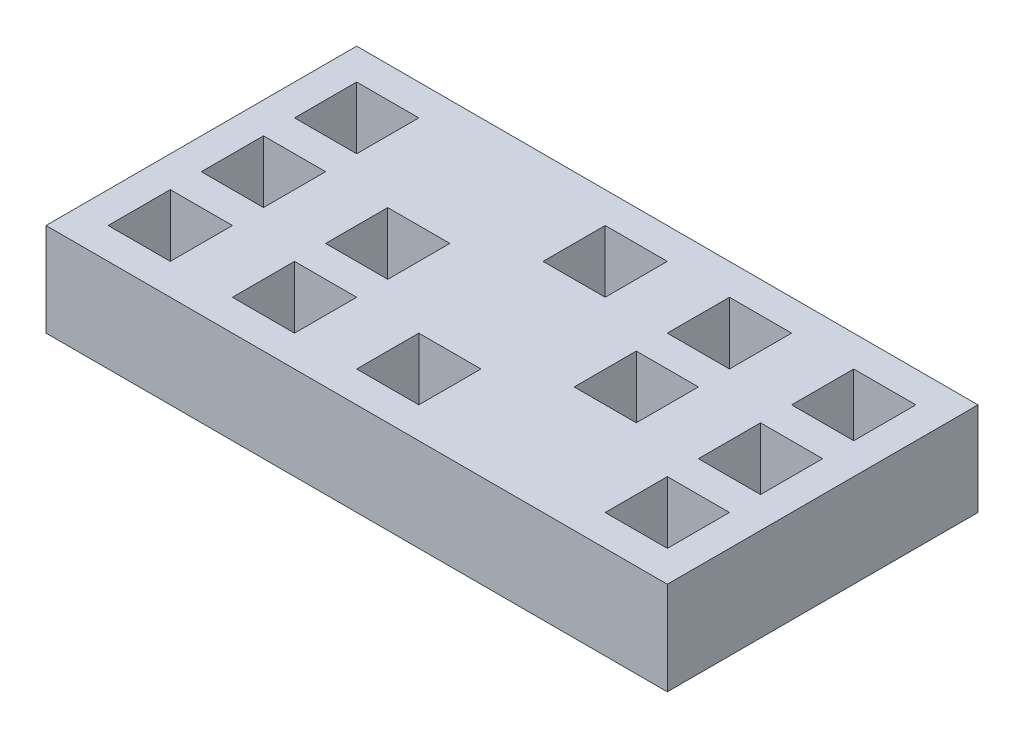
ISO-10303-21;
HEADER;
FILE_DESCRIPTION(('STEP AP214'),'2;1');
FILE_NAME('part.step','',(''),(''),'','','');
FILE_SCHEMA(('AUTOMOTIVE_DESIGN { 1 0 10303 214 1 1 1 1 }'));
ENDSEC;
DATA;
#1=APPLICATION_CONTEXT('core data for automotive mechanical design processes');
#2=APPLICATION_PROTOCOL_DEFINITION('international standard','automotive_design',2000,#1);
#3=PRODUCT_CONTEXT('',#1,'mechanical');
#4=PRODUCT('Part','Part','',(#3));
#5=PRODUCT_RELATED_PRODUCT_CATEGORY('part','',(#4));
#6=PRODUCT_DEFINITION_FORMATION('','',#4);
#7=PRODUCT_DEFINITION_CONTEXT('part definition',#1,'design');
#8=PRODUCT_DEFINITION('design','',#6,#7);
#9=PRODUCT_DEFINITION_SHAPE('','',#8);
#10=(LENGTH_UNIT() NAMED_UNIT(*) SI_UNIT(.MILLI.,.METRE.));
#11=(NAMED_UNIT(*) PLANE_ANGLE_UNIT() SI_UNIT($,.RADIAN.));
#12=(NAMED_UNIT(*) SI_UNIT($,.STERADIAN.) SOLID_ANGLE_UNIT());
#13=UNCERTAINTY_MEASURE_WITH_UNIT(LENGTH_MEASURE(1.E-05),#10,'distance_accuracy_value','');
#14=(GEOMETRIC_REPRESENTATION_CONTEXT(3) GLOBAL_UNCERTAINTY_ASSIGNED_CONTEXT((#13)) GLOBAL_UNIT_ASSIGNED_CONTEXT((#10,
#11,#12)) REPRESENTATION_CONTEXT('',''));
#15=CARTESIAN_POINT('',(0.,0.,0.));
#16=DIRECTION('',(0.,0.,1.));
#17=DIRECTION('',(1.,0.,0.));
#18=AXIS2_PLACEMENT_3D('',#15,#16,#17);
#19=CARTESIAN_POINT('',(0.,7.5,-50.));
#20=DIRECTION('',(0.,-1.,0.));
#21=DIRECTION('',(0.,0.,-1.));
#22=AXIS2_PLACEMENT_3D('',#19,#20,#21);
#23=PLANE('',#22);
#24=DIRECTION('',(1.,0.,0.));
#25=VECTOR('',#24,1.);
#26=CARTESIAN_POINT('',(64.9999999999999,7.5,-35.));
#27=LINE('',#26,#25);
#28=CARTESIAN_POINT('',(64.9999999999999,7.5,-35.));
#29=VERTEX_POINT('',#28);
#30=CARTESIAN_POINT('',(74.9999999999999,7.5,-35.));
#31=VERTEX_POINT('',#30);
#32=EDGE_CURVE('E409',#29,#31,#27,.T.);
#33=ORIENTED_EDGE('',*,*,#32,.F.);
#34=DIRECTION('',(0.,0.,1.));
#35=VECTOR('',#34,1.);
#36=CARTESIAN_POINT('',(64.9999999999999,7.5,-35.));
#37=LINE('',#36,#35);
#38=CARTESIAN_POINT('',(64.9999999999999,7.5,-45.));
#39=VERTEX_POINT('',#38);
#40=EDGE_CURVE('E416',#39,#29,#37,.T.);
#41=ORIENTED_EDGE('',*,*,#40,.F.);
#42=DIRECTION('',(-1.,0.,0.));
#43=VECTOR('',#42,1.);
#44=CARTESIAN_POINT('',(64.9999999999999,7.5,-45.));
#45=LINE('',#44,#43);
#46=CARTESIAN_POINT('',(74.9999999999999,7.5,-45.));
#47=VERTEX_POINT('',#46);
#48=EDGE_CURVE('E413',#47,#39,#45,.T.);
#49=ORIENTED_EDGE('',*,*,#48,.F.);
#50=DIRECTION('',(0.,0.,-1.));
#51=VECTOR('',#50,1.);
#52=CARTESIAN_POINT('',(74.9999999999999,7.5,-35.));
#53=LINE('',#52,#51);
#54=EDGE_CURVE('E411',#31,#47,#53,.T.);
#55=ORIENTED_EDGE('',*,*,#54,.F.);
#56=EDGE_LOOP('',(#33,#41,#49,#55));
#57=FACE_BOUND('',#56,.T.);
#58=DIRECTION('',(1.,0.,0.));
#59=VECTOR('',#58,1.);
#60=CARTESIAN_POINT('',(4.99999999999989,7.5,-35.));
#61=LINE('',#60,#59);
#62=CARTESIAN_POINT('',(4.99999999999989,7.5,-35.));
#63=VERTEX_POINT('',#62);
#64=CARTESIAN_POINT('',(14.9999999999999,7.5,-35.));
#65=VERTEX_POINT('',#64);
#66=EDGE_CURVE('E471',#63,#65,#61,.T.);
#67=ORIENTED_EDGE('',*,*,#66,.F.);
#68=DIRECTION('',(0.,0.,1.));
#69=VECTOR('',#68,1.);
#70=CARTESIAN_POINT('',(4.99999999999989,7.5,-35.));
#71=LINE('',#70,#69);
#72=CARTESIAN_POINT('',(4.99999999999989,7.5,-45.));
#73=VERTEX_POINT('',#72);
#74=EDGE_CURVE('E478',#73,#63,#71,.T.);
#75=ORIENTED_EDGE('',*,*,#74,.F.);
#76=DIRECTION('',(-1.,0.,0.));
#77=VECTOR('',#76,1.);
#78=CARTESIAN_POINT('',(4.99999999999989,7.5,-45.));
#79=LINE('',#78,#77);
#80=CARTESIAN_POINT('',(14.9999999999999,7.5,-45.));
#81=VERTEX_POINT('',#80);
#82=EDGE_CURVE('E475',#81,#73,#79,.T.);
#83=ORIENTED_EDGE('',*,*,#82,.F.);
#84=DIRECTION('',(0.,0.,-1.));
#85=VECTOR('',#84,1.);
#86=CARTESIAN_POINT('',(14.9999999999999,7.5,-35.));
#87=LINE('',#86,#85);
#88=EDGE_CURVE('E473',#65,#81,#87,.T.);
#89=ORIENTED_EDGE('',*,*,#88,.F.);
#90=EDGE_LOOP('',(#67,#75,#83,#89));
#91=FACE_BOUND('',#90,.T.);
#92=DIRECTION('',(1.,0.,0.));
#93=VECTOR('',#92,1.);
#94=CARTESIAN_POINT('',(64.9999999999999,7.5,-20.));
#95=LINE('',#94,#93);
#96=CARTESIAN_POINT('',(64.9999999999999,7.5,-20.));
#97=VERTEX_POINT('',#96);
#98=CARTESIAN_POINT('',(74.9999999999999,7.5,-20.));
#99=VERTEX_POINT('',#98);
#100=EDGE_CURVE('E533',#97,#99,#95,.T.);
#101=ORIENTED_EDGE('',*,*,#100,.F.);
#102=DIRECTION('',(0.,0.,1.));
#103=VECTOR('',#102,1.);
#104=CARTESIAN_POINT('',(64.9999999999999,7.5,-20.));
#105=LINE('',#104,#103);
#106=CARTESIAN_POINT('',(64.9999999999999,7.5,-30.));
#107=VERTEX_POINT('',#106);
#108=EDGE_CURVE('E540',#107,#97,#105,.T.);
#109=ORIENTED_EDGE('',*,*,#108,.F.);
#110=DIRECTION('',(-1.,0.,0.));
#111=VECTOR('',#110,1.);
#112=CARTESIAN_POINT('',(64.9999999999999,7.5,-30.));
#113=LINE('',#112,#111);
#114=CARTESIAN_POINT('',(74.9999999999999,7.5,-30.));
#115=VERTEX_POINT('',#114);
#116=EDGE_CURVE('E537',#115,#107,#113,.T.);
#117=ORIENTED_EDGE('',*,*,#116,.F.);
#118=DIRECTION('',(0.,0.,-1.));
#119=VECTOR('',#118,1.);
#120=CARTESIAN_POINT('',(74.9999999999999,7.5,-20.));
#121=LINE('',#120,#119);
#122=EDGE_CURVE('E535',#99,#115,#121,.T.);
#123=ORIENTED_EDGE('',*,*,#122,.F.);
#124=EDGE_LOOP('',(#101,#109,#117,#123));
#125=FACE_BOUND('',#124,.T.);
#126=DIRECTION('',(1.,0.,0.));
#127=VECTOR('',#126,1.);
#128=CARTESIAN_POINT('',(4.99999999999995,7.5,-20.));
#129=LINE('',#128,#127);
#130=CARTESIAN_POINT('',(4.99999999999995,7.5,-20.));
#131=VERTEX_POINT('',#130);
#132=CARTESIAN_POINT('',(14.9999999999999,7.5,-20.));
#133=VERTEX_POINT('',#132);
#134=EDGE_CURVE('E595',#131,#133,#129,.T.);
#135=ORIENTED_EDGE('',*,*,#134,.F.);
#136=DIRECTION('',(0.,0.,1.));
#137=VECTOR('',#136,1.);
#138=CARTESIAN_POINT('',(4.99999999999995,7.5,-20.));
#139=LINE('',#138,#137);
#140=CARTESIAN_POINT('',(4.99999999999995,7.5,-30.));
#141=VERTEX_POINT('',#140);
#142=EDGE_CURVE('E602',#141,#131,#139,.T.);
#143=ORIENTED_EDGE('',*,*,#142,.F.);
#144=DIRECTION('',(-1.,0.,0.));
#145=VECTOR('',#144,1.);
#146=CARTESIAN_POINT('',(4.99999999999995,7.5,-30.));
#147=LINE('',#146,#145);
#148=CARTESIAN_POINT('',(14.9999999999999,7.5,-30.));
#149=VERTEX_POINT('',#148);
#150=EDGE_CURVE('E599',#149,#141,#147,.T.);
#151=ORIENTED_EDGE('',*,*,#150,.F.);
#152=DIRECTION('',(0.,0.,-1.));
#153=VECTOR('',#152,1.);
#154=CARTESIAN_POINT('',(14.9999999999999,7.5,-20.));
#155=LINE('',#154,#153);
#156=EDGE_CURVE('E597',#133,#149,#155,.T.);
#157=ORIENTED_EDGE('',*,*,#156,.F.);
#158=EDGE_LOOP('',(#135,#143,#151,#157));
#159=FACE_BOUND('',#158,.T.);
#160=DIRECTION('',(1.,0.,0.));
#161=VECTOR('',#160,1.);
#162=CARTESIAN_POINT('',(45.,7.5,-5.));
#163=LINE('',#162,#161);
#164=CARTESIAN_POINT('',(45.,7.5,-5.));
#165=VERTEX_POINT('',#164);
#166=CARTESIAN_POINT('',(55.,7.5,-5.));
#167=VERTEX_POINT('',#166);
#168=EDGE_CURVE('E657',#165,#167,#163,.T.);
#169=ORIENTED_EDGE('',*,*,#168,.F.);
#170=DIRECTION('',(0.,0.,1.));
#171=VECTOR('',#170,1.);
#172=CARTESIAN_POINT('',(45.,7.5,-5.));
#173=LINE('',#172,#171);
#174=CARTESIAN_POINT('',(45.,7.5,-15.));
#175=VERTEX_POINT('',#174);
#176=EDGE_CURVE('E664',#175,#165,#173,.T.);
#177=ORIENTED_EDGE('',*,*,#176,.F.);
#178=DIRECTION('',(-1.,0.,0.));
#179=VECTOR('',#178,1.);
#180=CARTESIAN_POINT('',(45.,7.5,-15.));
#181=LINE('',#180,#179);
#182=CARTESIAN_POINT('',(55.,7.5,-15.));
#183=VERTEX_POINT('',#182);
#184=EDGE_CURVE('E661',#183,#175,#181,.T.);
#185=ORIENTED_EDGE('',*,*,#184,.F.);
#186=DIRECTION('',(0.,0.,-1.));
#187=VECTOR('',#186,1.);
#188=CARTESIAN_POINT('',(55.,7.5,-5.));
#189=LINE('',#188,#187);
#190=EDGE_CURVE('E659',#167,#183,#189,.T.);
#191=ORIENTED_EDGE('',*,*,#190,.F.);
#192=EDGE_LOOP('',(#169,#177,#185,#191));
#193=FACE_BOUND('',#192,.T.);
#194=DIRECTION('',(0.,0.,1.));
#195=VECTOR('',#194,1.);
#196=CARTESIAN_POINT('',(5.,7.5,-5.));
#197=LINE('',#196,#195);
#198=CARTESIAN_POINT('',(5.,7.5,-15.));
#199=VERTEX_POINT('',#198);
#200=CARTESIAN_POINT('',(5.,7.5,-5.));
#201=VERTEX_POINT('',#200);
#202=EDGE_CURVE('E719',#199,#201,#197,.T.);
#203=ORIENTED_EDGE('',*,*,#202,.F.);
#204=DIRECTION('',(-1.,0.,0.));
#205=VECTOR('',#204,1.);
#206=CARTESIAN_POINT('',(5.,7.5,-15.));
#207=LINE('',#206,#205);
#208=CARTESIAN_POINT('',(15.,7.5,-15.));
#209=VERTEX_POINT('',#208);
#210=EDGE_CURVE('E726',#209,#199,#207,.T.);
#211=ORIENTED_EDGE('',*,*,#210,.F.);
#212=DIRECTION('',(0.,0.,-1.));
#213=VECTOR('',#212,1.);
#214=CARTESIAN_POINT('',(15.,7.5,-5.));
#215=LINE('',#214,#213);
#216=CARTESIAN_POINT('',(15.,7.5,-5.));
#217=VERTEX_POINT('',#216);
#218=EDGE_CURVE('E723',#217,#209,#215,.T.);
#219=ORIENTED_EDGE('',*,*,#218,.F.);
#220=DIRECTION('',(1.,0.,0.));
#221=VECTOR('',#220,1.);
#222=CARTESIAN_POINT('',(5.,7.5,-5.));
#223=LINE('',#222,#221);
#224=EDGE_CURVE('E721',#201,#217,#223,.T.);
#225=ORIENTED_EDGE('',*,*,#224,.F.);
#226=EDGE_LOOP('',(#203,#211,#219,#225));
#227=FACE_BOUND('',#226,.T.);
#228=DIRECTION('',(0.,0.,1.));
#229=VECTOR('',#228,1.);
#230=CARTESIAN_POINT('',(0.,7.5,0.));
#231=LINE('',#230,#229);
#232=CARTESIAN_POINT('',(0.,7.5,-50.));
#233=VERTEX_POINT('',#232);
#234=CARTESIAN_POINT('',(0.,7.5,0.));
#235=VERTEX_POINT('',#234);
#236=EDGE_CURVE('E747',#233,#235,#231,.T.);
#237=ORIENTED_EDGE('',*,*,#236,.T.);
#238=DIRECTION('',(1.,0.,0.));
#239=VECTOR('',#238,1.);
#240=CARTESIAN_POINT('',(0.,7.5,0.));
#241=LINE('',#240,#239);
#242=CARTESIAN_POINT('',(100.,7.5,0.));
#243=VERTEX_POINT('',#242);
#244=EDGE_CURVE('E750',#235,#243,#241,.T.);
#245=ORIENTED_EDGE('',*,*,#244,.T.);
#246=DIRECTION('',(0.,0.,-1.));
#247=VECTOR('',#246,1.);
#248=CARTESIAN_POINT('',(100.,7.5,0.));
#249=LINE('',#248,#247);
#250=CARTESIAN_POINT('',(100.,7.5,-50.));
#251=VERTEX_POINT('',#250);
#252=EDGE_CURVE('E752',#243,#251,#249,.T.);
#253=ORIENTED_EDGE('',*,*,#252,.T.);
#254=DIRECTION('',(-1.,0.,0.));
#255=VECTOR('',#254,1.);
#256=CARTESIAN_POINT('',(0.,7.5,-50.));
#257=LINE('',#256,#255);
#258=EDGE_CURVE('E754',#251,#233,#257,.T.);
#259=ORIENTED_EDGE('',*,*,#258,.T.);
#260=EDGE_LOOP('',(#237,#245,#253,#259));
#261=FACE_BOUND('',#260,.T.);
#262=DIRECTION('',(1.,0.,0.));
#263=VECTOR('',#262,1.);
#264=CARTESIAN_POINT('',(25.,7.5,-5.));
#265=LINE('',#264,#263);
#266=CARTESIAN_POINT('',(25.,7.5,-5.));
#267=VERTEX_POINT('',#266);
#268=CARTESIAN_POINT('',(35.,7.5,-5.));
#269=VERTEX_POINT('',#268);
#270=EDGE_CURVE('E688',#267,#269,#265,.T.);
#271=ORIENTED_EDGE('',*,*,#270,.F.);
#272=DIRECTION('',(0.,0.,1.));
#273=VECTOR('',#272,1.);
#274=CARTESIAN_POINT('',(25.,7.5,-5.));
#275=LINE('',#274,#273);
#276=CARTESIAN_POINT('',(25.,7.5,-15.));
#277=VERTEX_POINT('',#276);
#278=EDGE_CURVE('E695',#277,#267,#275,.T.);
#279=ORIENTED_EDGE('',*,*,#278,.F.);
#280=DIRECTION('',(-1.,0.,0.));
#281=VECTOR('',#280,1.);
#282=CARTESIAN_POINT('',(25.,7.5,-15.));
#283=LINE('',#282,#281);
#284=CARTESIAN_POINT('',(35.,7.5,-15.));
#285=VERTEX_POINT('',#284);
#286=EDGE_CURVE('E692',#285,#277,#283,.T.);
#287=ORIENTED_EDGE('',*,*,#286,.F.);
#288=DIRECTION('',(0.,0.,-1.));
#289=VECTOR('',#288,1.);
#290=CARTESIAN_POINT('',(35.,7.5,-5.));
#291=LINE('',#290,#289);
#292=EDGE_CURVE('E690',#269,#285,#291,.T.);
#293=ORIENTED_EDGE('',*,*,#292,.F.);
#294=EDGE_LOOP('',(#271,#279,#287,#293));
#295=FACE_BOUND('',#294,.T.);
#296=DIRECTION('',(1.,0.,0.));
#297=VECTOR('',#296,1.);
#298=CARTESIAN_POINT('',(85.,7.5,-5.));
#299=LINE('',#298,#297);
#300=CARTESIAN_POINT('',(85.,7.5,-5.));
#301=VERTEX_POINT('',#300);
#302=CARTESIAN_POINT('',(95.,7.5,-5.));
#303=VERTEX_POINT('',#302);
#304=EDGE_CURVE('E626',#301,#303,#299,.T.);
#305=ORIENTED_EDGE('',*,*,#304,.F.);
#306=DIRECTION('',(0.,0.,1.));
#307=VECTOR('',#306,1.);
#308=CARTESIAN_POINT('',(85.,7.5,-5.));
#309=LINE('',#308,#307);
#310=CARTESIAN_POINT('',(85.,7.5,-15.));
#311=VERTEX_POINT('',#310);
#312=EDGE_CURVE('E633',#311,#301,#309,.T.);
#313=ORIENTED_EDGE('',*,*,#312,.F.);
#314=DIRECTION('',(-1.,0.,0.));
#315=VECTOR('',#314,1.);
#316=CARTESIAN_POINT('',(85.,7.5,-15.));
#317=LINE('',#316,#315);
#318=CARTESIAN_POINT('',(95.,7.5,-15.));
#319=VERTEX_POINT('',#318);
#320=EDGE_CURVE('E630',#319,#311,#317,.T.);
#321=ORIENTED_EDGE('',*,*,#320,.F.);
#322=DIRECTION('',(0.,0.,-1.));
#323=VECTOR('',#322,1.);
#324=CARTESIAN_POINT('',(95.,7.5,-5.));
#325=LINE('',#324,#323);
#326=EDGE_CURVE('E628',#303,#319,#325,.T.);
#327=ORIENTED_EDGE('',*,*,#326,.F.);
#328=EDGE_LOOP('',(#305,#313,#321,#327));
#329=FACE_BOUND('',#328,.T.);
#330=DIRECTION('',(1.,0.,0.));
#331=VECTOR('',#330,1.);
#332=CARTESIAN_POINT('',(24.9999999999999,7.5,-20.));
#333=LINE('',#332,#331);
#334=CARTESIAN_POINT('',(24.9999999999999,7.5,-20.));
#335=VERTEX_POINT('',#334);
#336=CARTESIAN_POINT('',(35.,7.5,-20.));
#337=VERTEX_POINT('',#336);
#338=EDGE_CURVE('E564',#335,#337,#333,.T.);
#339=ORIENTED_EDGE('',*,*,#338,.F.);
#340=DIRECTION('',(0.,0.,1.));
#341=VECTOR('',#340,1.);
#342=CARTESIAN_POINT('',(24.9999999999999,7.5,-20.));
#343=LINE('',#342,#341);
#344=CARTESIAN_POINT('',(24.9999999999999,7.5,-30.));
#345=VERTEX_POINT('',#344);
#346=EDGE_CURVE('E571',#345,#335,#343,.T.);
#347=ORIENTED_EDGE('',*,*,#346,.F.);
#348=DIRECTION('',(-1.,0.,0.));
#349=VECTOR('',#348,1.);
#350=CARTESIAN_POINT('',(24.9999999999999,7.5,-30.));
#351=LINE('',#350,#349);
#352=CARTESIAN_POINT('',(35.,7.5,-30.));
#353=VERTEX_POINT('',#352);
#354=EDGE_CURVE('E568',#353,#345,#351,.T.);
#355=ORIENTED_EDGE('',*,*,#354,.F.);
#356=DIRECTION('',(0.,0.,-1.));
#357=VECTOR('',#356,1.);
#358=CARTESIAN_POINT('',(35.,7.5,-20.));
#359=LINE('',#358,#357);
#360=EDGE_CURVE('E566',#337,#353,#359,.T.);
#361=ORIENTED_EDGE('',*,*,#360,.F.);
#362=EDGE_LOOP('',(#339,#347,#355,#361));
#363=FACE_BOUND('',#362,.T.);
#364=DIRECTION('',(1.,0.,0.));
#365=VECTOR('',#364,1.);
#366=CARTESIAN_POINT('',(85.,7.5,-20.));
#367=LINE('',#366,#365);
#368=CARTESIAN_POINT('',(85.,7.5,-20.));
#369=VERTEX_POINT('',#368);
#370=CARTESIAN_POINT('',(94.9999999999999,7.5,-20.));
#371=VERTEX_POINT('',#370);
#372=EDGE_CURVE('E502',#369,#371,#367,.T.);
#373=ORIENTED_EDGE('',*,*,#372,.F.);
#374=DIRECTION('',(0.,0.,1.));
#375=VECTOR('',#374,1.);
#376=CARTESIAN_POINT('',(85.,7.5,-20.));
#377=LINE('',#376,#375);
#378=CARTESIAN_POINT('',(84.9999999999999,7.5,-30.));
#379=VERTEX_POINT('',#378);
#380=EDGE_CURVE('E509',#379,#369,#377,.T.);
#381=ORIENTED_EDGE('',*,*,#380,.F.);
#382=DIRECTION('',(-1.,0.,0.));
#383=VECTOR('',#382,1.);
#384=CARTESIAN_POINT('',(84.9999999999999,7.5,-30.));
#385=LINE('',#384,#383);
#386=CARTESIAN_POINT('',(94.9999999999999,7.5,-30.));
#387=VERTEX_POINT('',#386);
#388=EDGE_CURVE('E506',#387,#379,#385,.T.);
#389=ORIENTED_EDGE('',*,*,#388,.F.);
#390=DIRECTION('',(0.,0.,-1.));
#391=VECTOR('',#390,1.);
#392=CARTESIAN_POINT('',(94.9999999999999,7.5,-20.));
#393=LINE('',#392,#391);
#394=EDGE_CURVE('E504',#371,#387,#393,.T.);
#395=ORIENTED_EDGE('',*,*,#394,.F.);
#396=EDGE_LOOP('',(#373,#381,#389,#395));
#397=FACE_BOUND('',#396,.T.);
#398=DIRECTION('',(1.,0.,0.));
#399=VECTOR('',#398,1.);
#400=CARTESIAN_POINT('',(44.9999999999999,7.5,-35.));
#401=LINE('',#400,#399);
#402=CARTESIAN_POINT('',(44.9999999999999,7.5,-35.));
#403=VERTEX_POINT('',#402);
#404=CARTESIAN_POINT('',(54.9999999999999,7.5,-35.));
#405=VERTEX_POINT('',#404);
#406=EDGE_CURVE('E440',#403,#405,#401,.T.);
#407=ORIENTED_EDGE('',*,*,#406,.F.);
#408=DIRECTION('',(0.,0.,1.));
#409=VECTOR('',#408,1.);
#410=CARTESIAN_POINT('',(44.9999999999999,7.5,-35.));
#411=LINE('',#410,#409);
#412=CARTESIAN_POINT('',(44.9999999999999,7.5,-45.));
#413=VERTEX_POINT('',#412);
#414=EDGE_CURVE('E447',#413,#403,#411,.T.);
#415=ORIENTED_EDGE('',*,*,#414,.F.);
#416=DIRECTION('',(-1.,0.,0.));
#417=VECTOR('',#416,1.);
#418=CARTESIAN_POINT('',(44.9999999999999,7.5,-45.));
#419=LINE('',#418,#417);
#420=CARTESIAN_POINT('',(54.9999999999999,7.5,-45.));
#421=VERTEX_POINT('',#420);
#422=EDGE_CURVE('E444',#421,#413,#419,.T.);
#423=ORIENTED_EDGE('',*,*,#422,.F.);
#424=DIRECTION('',(0.,0.,-1.));
#425=VECTOR('',#424,1.);
#426=CARTESIAN_POINT('',(54.9999999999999,7.5,-35.));
#427=LINE('',#426,#425);
#428=EDGE_CURVE('E442',#405,#421,#427,.T.);
#429=ORIENTED_EDGE('',*,*,#428,.F.);
#430=EDGE_LOOP('',(#407,#415,#423,#429));
#431=FACE_BOUND('',#430,.T.);
#432=DIRECTION('',(1.,0.,0.));
#433=VECTOR('',#432,1.);
#434=CARTESIAN_POINT('',(84.9999999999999,7.5,-35.));
#435=LINE('',#434,#433);
#436=CARTESIAN_POINT('',(84.9999999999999,7.5,-35.));
#437=VERTEX_POINT('',#436);
#438=CARTESIAN_POINT('',(94.9999999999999,7.5,-35.));
#439=VERTEX_POINT('',#438);
#440=EDGE_CURVE('E377',#437,#439,#435,.T.);
#441=ORIENTED_EDGE('',*,*,#440,.F.);
#442=DIRECTION('',(0.,0.,1.));
#443=VECTOR('',#442,1.);
#444=CARTESIAN_POINT('',(84.9999999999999,7.5,-35.));
#445=LINE('',#444,#443);
#446=CARTESIAN_POINT('',(84.9999999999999,7.5,-45.));
#447=VERTEX_POINT('',#446);
#448=EDGE_CURVE('E392',#447,#437,#445,.T.);
#449=ORIENTED_EDGE('',*,*,#448,.F.);
#450=DIRECTION('',(-1.,0.,0.));
#451=VECTOR('',#450,1.);
#452=CARTESIAN_POINT('',(84.9999999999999,7.5,-45.));
#453=LINE('',#452,#451);
#454=CARTESIAN_POINT('',(94.9999999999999,7.5,-45.));
#455=VERTEX_POINT('',#454);
#456=EDGE_CURVE('E390',#455,#447,#453,.T.);
#457=ORIENTED_EDGE('',*,*,#456,.F.);
#458=DIRECTION('',(0.,0.,-1.));
#459=VECTOR('',#458,1.);
#460=CARTESIAN_POINT('',(94.9999999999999,7.5,-35.));
#461=LINE('',#460,#459);
#462=EDGE_CURVE('E388',#439,#455,#461,.T.);
#463=ORIENTED_EDGE('',*,*,#462,.F.);
#464=EDGE_LOOP('',(#441,#449,#457,#463));
#465=FACE_BOUND('',#464,.T.);
#466=ADVANCED_FACE('F33',(#57,#91,#125,#159,#193,#227,#261,#295,#329,#363,#397,#431,#465),#23,.F.);
#467=CARTESIAN_POINT('',(0.,-7.5,-50.));
#468=DIRECTION('',(0.,-1.,0.));
#469=DIRECTION('',(0.,0.,-1.));
#470=AXIS2_PLACEMENT_3D('',#467,#468,#469);
#471=PLANE('',#470);
#472=DIRECTION('',(0.,0.,1.));
#473=VECTOR('',#472,1.);
#474=CARTESIAN_POINT('',(64.9999999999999,-7.5,-35.));
#475=LINE('',#474,#473);
#476=CARTESIAN_POINT('',(64.9999999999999,-7.5,-45.));
#477=VERTEX_POINT('',#476);
#478=CARTESIAN_POINT('',(64.9999999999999,-7.5,-35.));
#479=VERTEX_POINT('',#478);
#480=EDGE_CURVE('E406',#477,#479,#475,.T.);
#481=ORIENTED_EDGE('',*,*,#480,.T.);
#482=DIRECTION('',(1.,0.,0.));
#483=VECTOR('',#482,1.);
#484=CARTESIAN_POINT('',(64.9999999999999,-7.5,-35.));
#485=LINE('',#484,#483);
#486=CARTESIAN_POINT('',(74.9999999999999,-7.5,-35.));
#487=VERTEX_POINT('',#486);
#488=EDGE_CURVE('E378',#479,#487,#485,.T.);
#489=ORIENTED_EDGE('',*,*,#488,.T.);
#490=DIRECTION('',(0.,0.,-1.));
#491=VECTOR('',#490,1.);
#492=CARTESIAN_POINT('',(74.9999999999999,-7.5,-35.));
#493=LINE('',#492,#491);
#494=CARTESIAN_POINT('',(74.9999999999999,-7.5,-45.));
#495=VERTEX_POINT('',#494);
#496=EDGE_CURVE('E400',#487,#495,#493,.T.);
#497=ORIENTED_EDGE('',*,*,#496,.T.);
#498=DIRECTION('',(-1.,0.,0.));
#499=VECTOR('',#498,1.);
#500=CARTESIAN_POINT('',(64.9999999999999,-7.5,-45.));
#501=LINE('',#500,#499);
#502=EDGE_CURVE('E403',#495,#477,#501,.T.);
#503=ORIENTED_EDGE('',*,*,#502,.T.);
#504=EDGE_LOOP('',(#481,#489,#497,#503));
#505=FACE_BOUND('',#504,.T.);
#506=DIRECTION('',(0.,0.,1.));
#507=VECTOR('',#506,1.);
#508=CARTESIAN_POINT('',(4.99999999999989,-7.5,-35.));
#509=LINE('',#508,#507);
#510=CARTESIAN_POINT('',(4.99999999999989,-7.5,-45.));
#511=VERTEX_POINT('',#510);
#512=CARTESIAN_POINT('',(4.99999999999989,-7.5,-35.));
#513=VERTEX_POINT('',#512);
#514=EDGE_CURVE('E468',#511,#513,#509,.T.);
#515=ORIENTED_EDGE('',*,*,#514,.T.);
#516=DIRECTION('',(1.,0.,0.));
#517=VECTOR('',#516,1.);
#518=CARTESIAN_POINT('',(4.99999999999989,-7.5,-35.));
#519=LINE('',#518,#517);
#520=CARTESIAN_POINT('',(14.9999999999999,-7.5,-35.));
#521=VERTEX_POINT('',#520);
#522=EDGE_CURVE('E459',#513,#521,#519,.T.);
#523=ORIENTED_EDGE('',*,*,#522,.T.);
#524=DIRECTION('',(0.,0.,-1.));
#525=VECTOR('',#524,1.);
#526=CARTESIAN_POINT('',(14.9999999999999,-7.5,-35.));
#527=LINE('',#526,#525);
#528=CARTESIAN_POINT('',(14.9999999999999,-7.5,-45.));
#529=VERTEX_POINT('',#528);
#530=EDGE_CURVE('E462',#521,#529,#527,.T.);
#531=ORIENTED_EDGE('',*,*,#530,.T.);
#532=DIRECTION('',(-1.,0.,0.));
#533=VECTOR('',#532,1.);
#534=CARTESIAN_POINT('',(4.99999999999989,-7.5,-45.));
#535=LINE('',#534,#533);
#536=EDGE_CURVE('E465',#529,#511,#535,.T.);
#537=ORIENTED_EDGE('',*,*,#536,.T.);
#538=EDGE_LOOP('',(#515,#523,#531,#537));
#539=FACE_BOUND('',#538,.T.);
#540=DIRECTION('',(0.,0.,1.));
#541=VECTOR('',#540,1.);
#542=CARTESIAN_POINT('',(64.9999999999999,-7.5,-20.));
#543=LINE('',#542,#541);
#544=CARTESIAN_POINT('',(64.9999999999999,-7.5,-30.));
#545=VERTEX_POINT('',#544);
#546=CARTESIAN_POINT('',(64.9999999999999,-7.5,-20.));
#547=VERTEX_POINT('',#546);
#548=EDGE_CURVE('E530',#545,#547,#543,.T.);
#549=ORIENTED_EDGE('',*,*,#548,.T.);
#550=DIRECTION('',(1.,0.,0.));
#551=VECTOR('',#550,1.);
#552=CARTESIAN_POINT('',(64.9999999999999,-7.5,-20.));
#553=LINE('',#552,#551);
#554=CARTESIAN_POINT('',(74.9999999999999,-7.5,-20.));
#555=VERTEX_POINT('',#554);
#556=EDGE_CURVE('E521',#547,#555,#553,.T.);
#557=ORIENTED_EDGE('',*,*,#556,.T.);
#558=DIRECTION('',(0.,0.,-1.));
#559=VECTOR('',#558,1.);
#560=CARTESIAN_POINT('',(74.9999999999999,-7.5,-20.));
#561=LINE('',#560,#559);
#562=CARTESIAN_POINT('',(74.9999999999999,-7.5,-30.));
#563=VERTEX_POINT('',#562);
#564=EDGE_CURVE('E524',#555,#563,#561,.T.);
#565=ORIENTED_EDGE('',*,*,#564,.T.);
#566=DIRECTION('',(-1.,0.,0.));
#567=VECTOR('',#566,1.);
#568=CARTESIAN_POINT('',(64.9999999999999,-7.5,-30.));
#569=LINE('',#568,#567);
#570=EDGE_CURVE('E527',#563,#545,#569,.T.);
#571=ORIENTED_EDGE('',*,*,#570,.T.);
#572=EDGE_LOOP('',(#549,#557,#565,#571));
#573=FACE_BOUND('',#572,.T.);
#574=DIRECTION('',(0.,0.,1.));
#575=VECTOR('',#574,1.);
#576=CARTESIAN_POINT('',(4.99999999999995,-7.5,-20.));
#577=LINE('',#576,#575);
#578=CARTESIAN_POINT('',(4.99999999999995,-7.5,-30.));
#579=VERTEX_POINT('',#578);
#580=CARTESIAN_POINT('',(4.99999999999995,-7.5,-20.));
#581=VERTEX_POINT('',#580);
#582=EDGE_CURVE('E592',#579,#581,#577,.T.);
#583=ORIENTED_EDGE('',*,*,#582,.T.);
#584=DIRECTION('',(1.,0.,0.));
#585=VECTOR('',#584,1.);
#586=CARTESIAN_POINT('',(4.99999999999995,-7.5,-20.));
#587=LINE('',#586,#585);
#588=CARTESIAN_POINT('',(14.9999999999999,-7.5,-20.));
#589=VERTEX_POINT('',#588);
#590=EDGE_CURVE('E583',#581,#589,#587,.T.);
#591=ORIENTED_EDGE('',*,*,#590,.T.);
#592=DIRECTION('',(0.,0.,-1.));
#593=VECTOR('',#592,1.);
#594=CARTESIAN_POINT('',(14.9999999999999,-7.5,-20.));
#595=LINE('',#594,#593);
#596=CARTESIAN_POINT('',(14.9999999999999,-7.5,-30.));
#597=VERTEX_POINT('',#596);
#598=EDGE_CURVE('E586',#589,#597,#595,.T.);
#599=ORIENTED_EDGE('',*,*,#598,.T.);
#600=DIRECTION('',(-1.,0.,0.));
#601=VECTOR('',#600,1.);
#602=CARTESIAN_POINT('',(4.99999999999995,-7.5,-30.));
#603=LINE('',#602,#601);
#604=EDGE_CURVE('E589',#597,#579,#603,.T.);
#605=ORIENTED_EDGE('',*,*,#604,.T.);
#606=EDGE_LOOP('',(#583,#591,#599,#605));
#607=FACE_BOUND('',#606,.T.);
#608=DIRECTION('',(0.,0.,1.));
#609=VECTOR('',#608,1.);
#610=CARTESIAN_POINT('',(45.,-7.5,-5.));
#611=LINE('',#610,#609);
#612=CARTESIAN_POINT('',(45.,-7.5,-15.));
#613=VERTEX_POINT('',#612);
#614=CARTESIAN_POINT('',(45.,-7.5,-5.));
#615=VERTEX_POINT('',#614);
#616=EDGE_CURVE('E654',#613,#615,#611,.T.);
#617=ORIENTED_EDGE('',*,*,#616,.T.);
#618=DIRECTION('',(1.,0.,0.));
#619=VECTOR('',#618,1.);
#620=CARTESIAN_POINT('',(45.,-7.5,-5.));
#621=LINE('',#620,#619);
#622=CARTESIAN_POINT('',(55.,-7.5,-5.));
#623=VERTEX_POINT('',#622);
#624=EDGE_CURVE('E645',#615,#623,#621,.T.);
#625=ORIENTED_EDGE('',*,*,#624,.T.);
#626=DIRECTION('',(0.,0.,-1.));
#627=VECTOR('',#626,1.);
#628=CARTESIAN_POINT('',(55.,-7.5,-5.));
#629=LINE('',#628,#627);
#630=CARTESIAN_POINT('',(55.,-7.5,-15.));
#631=VERTEX_POINT('',#630);
#632=EDGE_CURVE('E648',#623,#631,#629,.T.);
#633=ORIENTED_EDGE('',*,*,#632,.T.);
#634=DIRECTION('',(-1.,0.,0.));
#635=VECTOR('',#634,1.);
#636=CARTESIAN_POINT('',(45.,-7.5,-15.));
#637=LINE('',#636,#635);
#638=EDGE_CURVE('E651',#631,#613,#637,.T.);
#639=ORIENTED_EDGE('',*,*,#638,.T.);
#640=EDGE_LOOP('',(#617,#625,#633,#639));
#641=FACE_BOUND('',#640,.T.);
#642=DIRECTION('',(-1.,0.,0.));
#643=VECTOR('',#642,1.);
#644=CARTESIAN_POINT('',(5.,-7.5,-15.));
#645=LINE('',#644,#643);
#646=CARTESIAN_POINT('',(15.,-7.5,-15.));
#647=VERTEX_POINT('',#646);
#648=CARTESIAN_POINT('',(5.,-7.5,-15.));
#649=VERTEX_POINT('',#648);
#650=EDGE_CURVE('E716',#647,#649,#645,.T.);
#651=ORIENTED_EDGE('',*,*,#650,.T.);
#652=DIRECTION('',(0.,0.,1.));
#653=VECTOR('',#652,1.);
#654=CARTESIAN_POINT('',(5.,-7.5,-5.));
#655=LINE('',#654,#653);
#656=CARTESIAN_POINT('',(5.,-7.5,-5.));
#657=VERTEX_POINT('',#656);
#658=EDGE_CURVE('E707',#649,#657,#655,.T.);
#659=ORIENTED_EDGE('',*,*,#658,.T.);
#660=DIRECTION('',(1.,0.,0.));
#661=VECTOR('',#660,1.);
#662=CARTESIAN_POINT('',(5.,-7.5,-5.));
#663=LINE('',#662,#661);
#664=CARTESIAN_POINT('',(15.,-7.5,-5.));
#665=VERTEX_POINT('',#664);
#666=EDGE_CURVE('E710',#657,#665,#663,.T.);
#667=ORIENTED_EDGE('',*,*,#666,.T.);
#668=DIRECTION('',(0.,0.,-1.));
#669=VECTOR('',#668,1.);
#670=CARTESIAN_POINT('',(15.,-7.5,-5.));
#671=LINE('',#670,#669);
#672=EDGE_CURVE('E713',#665,#647,#671,.T.);
#673=ORIENTED_EDGE('',*,*,#672,.T.);
#674=EDGE_LOOP('',(#651,#659,#667,#673));
#675=FACE_BOUND('',#674,.T.);
#676=DIRECTION('',(0.,0.,1.));
#677=VECTOR('',#676,1.);
#678=CARTESIAN_POINT('',(0.,-7.5,0.));
#679=LINE('',#678,#677);
#680=CARTESIAN_POINT('',(0.,-7.5,-50.));
#681=VERTEX_POINT('',#680);
#682=CARTESIAN_POINT('',(0.,-7.5,0.));
#683=VERTEX_POINT('',#682);
#684=EDGE_CURVE('E738',#681,#683,#679,.T.);
#685=ORIENTED_EDGE('',*,*,#684,.F.);
#686=DIRECTION('',(-1.,0.,0.));
#687=VECTOR('',#686,1.);
#688=CARTESIAN_POINT('',(0.,-7.5,-50.));
#689=LINE('',#688,#687);
#690=CARTESIAN_POINT('',(100.,-7.5,-50.));
#691=VERTEX_POINT('',#690);
#692=EDGE_CURVE('E745',#691,#681,#689,.T.);
#693=ORIENTED_EDGE('',*,*,#692,.F.);
#694=DIRECTION('',(0.,0.,-1.));
#695=VECTOR('',#694,1.);
#696=CARTESIAN_POINT('',(100.,-7.5,0.));
#697=LINE('',#696,#695);
#698=CARTESIAN_POINT('',(100.,-7.5,0.));
#699=VERTEX_POINT('',#698);
#700=EDGE_CURVE('E743',#699,#691,#697,.T.);
#701=ORIENTED_EDGE('',*,*,#700,.F.);
#702=DIRECTION('',(1.,0.,0.));
#703=VECTOR('',#702,1.);
#704=CARTESIAN_POINT('',(0.,-7.5,0.));
#705=LINE('',#704,#703);
#706=EDGE_CURVE('E741',#683,#699,#705,.T.);
#707=ORIENTED_EDGE('',*,*,#706,.F.);
#708=EDGE_LOOP('',(#685,#693,#701,#707));
#709=FACE_BOUND('',#708,.T.);
#710=DIRECTION('',(0.,0.,1.));
#711=VECTOR('',#710,1.);
#712=CARTESIAN_POINT('',(25.,-7.5,-5.));
#713=LINE('',#712,#711);
#714=CARTESIAN_POINT('',(25.,-7.5,-15.));
#715=VERTEX_POINT('',#714);
#716=CARTESIAN_POINT('',(25.,-7.5,-5.));
#717=VERTEX_POINT('',#716);
#718=EDGE_CURVE('E685',#715,#717,#713,.T.);
#719=ORIENTED_EDGE('',*,*,#718,.T.);
#720=DIRECTION('',(1.,0.,0.));
#721=VECTOR('',#720,1.);
#722=CARTESIAN_POINT('',(25.,-7.5,-5.));
#723=LINE('',#722,#721);
#724=CARTESIAN_POINT('',(35.,-7.5,-5.));
#725=VERTEX_POINT('',#724);
#726=EDGE_CURVE('E676',#717,#725,#723,.T.);
#727=ORIENTED_EDGE('',*,*,#726,.T.);
#728=DIRECTION('',(0.,0.,-1.));
#729=VECTOR('',#728,1.);
#730=CARTESIAN_POINT('',(35.,-7.5,-5.));
#731=LINE('',#730,#729);
#732=CARTESIAN_POINT('',(35.,-7.5,-15.));
#733=VERTEX_POINT('',#732);
#734=EDGE_CURVE('E679',#725,#733,#731,.T.);
#735=ORIENTED_EDGE('',*,*,#734,.T.);
#736=DIRECTION('',(-1.,0.,0.));
#737=VECTOR('',#736,1.);
#738=CARTESIAN_POINT('',(25.,-7.5,-15.));
#739=LINE('',#738,#737);
#740=EDGE_CURVE('E682',#733,#715,#739,.T.);
#741=ORIENTED_EDGE('',*,*,#740,.T.);
#742=EDGE_LOOP('',(#719,#727,#735,#741));
#743=FACE_BOUND('',#742,.T.);
#744=DIRECTION('',(0.,0.,1.));
#745=VECTOR('',#744,1.);
#746=CARTESIAN_POINT('',(85.,-7.5,-5.));
#747=LINE('',#746,#745);
#748=CARTESIAN_POINT('',(85.,-7.5,-15.));
#749=VERTEX_POINT('',#748);
#750=CARTESIAN_POINT('',(85.,-7.5,-5.));
#751=VERTEX_POINT('',#750);
#752=EDGE_CURVE('E623',#749,#751,#747,.T.);
#753=ORIENTED_EDGE('',*,*,#752,.T.);
#754=DIRECTION('',(1.,0.,0.));
#755=VECTOR('',#754,1.);
#756=CARTESIAN_POINT('',(85.,-7.5,-5.));
#757=LINE('',#756,#755);
#758=CARTESIAN_POINT('',(95.,-7.5,-5.));
#759=VERTEX_POINT('',#758);
#760=EDGE_CURVE('E614',#751,#759,#757,.T.);
#761=ORIENTED_EDGE('',*,*,#760,.T.);
#762=DIRECTION('',(0.,0.,-1.));
#763=VECTOR('',#762,1.);
#764=CARTESIAN_POINT('',(95.,-7.5,-5.));
#765=LINE('',#764,#763);
#766=CARTESIAN_POINT('',(95.,-7.5,-15.));
#767=VERTEX_POINT('',#766);
#768=EDGE_CURVE('E617',#759,#767,#765,.T.);
#769=ORIENTED_EDGE('',*,*,#768,.T.);
#770=DIRECTION('',(-1.,0.,0.));
#771=VECTOR('',#770,1.);
#772=CARTESIAN_POINT('',(85.,-7.5,-15.));
#773=LINE('',#772,#771);
#774=EDGE_CURVE('E620',#767,#749,#773,.T.);
#775=ORIENTED_EDGE('',*,*,#774,.T.);
#776=EDGE_LOOP('',(#753,#761,#769,#775));
#777=FACE_BOUND('',#776,.T.);
#778=DIRECTION('',(0.,0.,1.));
#779=VECTOR('',#778,1.);
#780=CARTESIAN_POINT('',(24.9999999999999,-7.5,-20.));
#781=LINE('',#780,#779);
#782=CARTESIAN_POINT('',(24.9999999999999,-7.5,-30.));
#783=VERTEX_POINT('',#782);
#784=CARTESIAN_POINT('',(24.9999999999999,-7.5,-20.));
#785=VERTEX_POINT('',#784);
#786=EDGE_CURVE('E561',#783,#785,#781,.T.);
#787=ORIENTED_EDGE('',*,*,#786,.T.);
#788=DIRECTION('',(1.,0.,0.));
#789=VECTOR('',#788,1.);
#790=CARTESIAN_POINT('',(24.9999999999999,-7.5,-20.));
#791=LINE('',#790,#789);
#792=CARTESIAN_POINT('',(35.,-7.5,-20.));
#793=VERTEX_POINT('',#792);
#794=EDGE_CURVE('E552',#785,#793,#791,.T.);
#795=ORIENTED_EDGE('',*,*,#794,.T.);
#796=DIRECTION('',(0.,0.,-1.));
#797=VECTOR('',#796,1.);
#798=CARTESIAN_POINT('',(35.,-7.5,-20.));
#799=LINE('',#798,#797);
#800=CARTESIAN_POINT('',(35.,-7.5,-30.));
#801=VERTEX_POINT('',#800);
#802=EDGE_CURVE('E555',#793,#801,#799,.T.);
#803=ORIENTED_EDGE('',*,*,#802,.T.);
#804=DIRECTION('',(-1.,0.,0.));
#805=VECTOR('',#804,1.);
#806=CARTESIAN_POINT('',(24.9999999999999,-7.5,-30.));
#807=LINE('',#806,#805);
#808=EDGE_CURVE('E558',#801,#783,#807,.T.);
#809=ORIENTED_EDGE('',*,*,#808,.T.);
#810=EDGE_LOOP('',(#787,#795,#803,#809));
#811=FACE_BOUND('',#810,.T.);
#812=DIRECTION('',(0.,0.,1.));
#813=VECTOR('',#812,1.);
#814=CARTESIAN_POINT('',(85.,-7.5,-20.));
#815=LINE('',#814,#813);
#816=CARTESIAN_POINT('',(84.9999999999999,-7.5,-30.));
#817=VERTEX_POINT('',#816);
#818=CARTESIAN_POINT('',(85.,-7.5,-20.));
#819=VERTEX_POINT('',#818);
#820=EDGE_CURVE('E499',#817,#819,#815,.T.);
#821=ORIENTED_EDGE('',*,*,#820,.T.);
#822=DIRECTION('',(1.,0.,0.));
#823=VECTOR('',#822,1.);
#824=CARTESIAN_POINT('',(85.,-7.5,-20.));
#825=LINE('',#824,#823);
#826=CARTESIAN_POINT('',(94.9999999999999,-7.5,-20.));
#827=VERTEX_POINT('',#826);
#828=EDGE_CURVE('E490',#819,#827,#825,.T.);
#829=ORIENTED_EDGE('',*,*,#828,.T.);
#830=DIRECTION('',(0.,0.,-1.));
#831=VECTOR('',#830,1.);
#832=CARTESIAN_POINT('',(94.9999999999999,-7.5,-20.));
#833=LINE('',#832,#831);
#834=CARTESIAN_POINT('',(94.9999999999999,-7.5,-30.));
#835=VERTEX_POINT('',#834);
#836=EDGE_CURVE('E493',#827,#835,#833,.T.);
#837=ORIENTED_EDGE('',*,*,#836,.T.);
#838=DIRECTION('',(-1.,0.,0.));
#839=VECTOR('',#838,1.);
#840=CARTESIAN_POINT('',(84.9999999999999,-7.5,-30.));
#841=LINE('',#840,#839);
#842=EDGE_CURVE('E496',#835,#817,#841,.T.);
#843=ORIENTED_EDGE('',*,*,#842,.T.);
#844=EDGE_LOOP('',(#821,#829,#837,#843));
#845=FACE_BOUND('',#844,.T.);
#846=DIRECTION('',(0.,0.,1.));
#847=VECTOR('',#846,1.);
#848=CARTESIAN_POINT('',(44.9999999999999,-7.5,-35.));
#849=LINE('',#848,#847);
#850=CARTESIAN_POINT('',(44.9999999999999,-7.5,-45.));
#851=VERTEX_POINT('',#850);
#852=CARTESIAN_POINT('',(44.9999999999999,-7.5,-35.));
#853=VERTEX_POINT('',#852);
#854=EDGE_CURVE('E437',#851,#853,#849,.T.);
#855=ORIENTED_EDGE('',*,*,#854,.T.);
#856=DIRECTION('',(1.,0.,0.));
#857=VECTOR('',#856,1.);
#858=CARTESIAN_POINT('',(44.9999999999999,-7.5,-35.));
#859=LINE('',#858,#857);
#860=CARTESIAN_POINT('',(54.9999999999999,-7.5,-35.));
#861=VERTEX_POINT('',#860);
#862=EDGE_CURVE('E428',#853,#861,#859,.T.);
#863=ORIENTED_EDGE('',*,*,#862,.T.);
#864=DIRECTION('',(0.,0.,-1.));
#865=VECTOR('',#864,1.);
#866=CARTESIAN_POINT('',(54.9999999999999,-7.5,-35.));
#867=LINE('',#866,#865);
#868=CARTESIAN_POINT('',(54.9999999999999,-7.5,-45.));
#869=VERTEX_POINT('',#868);
#870=EDGE_CURVE('E431',#861,#869,#867,.T.);
#871=ORIENTED_EDGE('',*,*,#870,.T.);
#872=DIRECTION('',(-1.,0.,0.));
#873=VECTOR('',#872,1.);
#874=CARTESIAN_POINT('',(44.9999999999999,-7.5,-45.));
#875=LINE('',#874,#873);
#876=EDGE_CURVE('E434',#869,#851,#875,.T.);
#877=ORIENTED_EDGE('',*,*,#876,.T.);
#878=EDGE_LOOP('',(#855,#863,#871,#877));
#879=FACE_BOUND('',#878,.T.);
#880=DIRECTION('',(0.,0.,1.));
#881=VECTOR('',#880,1.);
#882=CARTESIAN_POINT('',(84.9999999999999,-7.5,-35.));
#883=LINE('',#882,#881);
#884=CARTESIAN_POINT('',(84.9999999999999,-7.5,-45.));
#885=VERTEX_POINT('',#884);
#886=CARTESIAN_POINT('',(84.9999999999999,-7.5,-35.));
#887=VERTEX_POINT('',#886);
#888=EDGE_CURVE('E382',#885,#887,#883,.T.);
#889=ORIENTED_EDGE('',*,*,#888,.T.);
#890=DIRECTION('',(1.,0.,0.));
#891=VECTOR('',#890,1.);
#892=CARTESIAN_POINT('',(84.9999999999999,-7.5,-35.));
#893=LINE('',#892,#891);
#894=CARTESIAN_POINT('',(94.9999999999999,-7.5,-35.));
#895=VERTEX_POINT('',#894);
#896=EDGE_CURVE('E56',#887,#895,#893,.T.);
#897=ORIENTED_EDGE('',*,*,#896,.T.);
#898=DIRECTION('',(0.,0.,-1.));
#899=VECTOR('',#898,1.);
#900=CARTESIAN_POINT('',(94.9999999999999,-7.5,-35.));
#901=LINE('',#900,#899);
#902=CARTESIAN_POINT('',(94.9999999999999,-7.5,-45.));
#903=VERTEX_POINT('',#902);
#904=EDGE_CURVE('E364',#895,#903,#901,.T.);
#905=ORIENTED_EDGE('',*,*,#904,.T.);
#906=DIRECTION('',(-1.,0.,0.));
#907=VECTOR('',#906,1.);
#908=CARTESIAN_POINT('',(84.9999999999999,-7.5,-45.));
#909=LINE('',#908,#907);
#910=EDGE_CURVE('E373',#903,#885,#909,.T.);
#911=ORIENTED_EDGE('',*,*,#910,.T.);
#912=EDGE_LOOP('',(#889,#897,#905,#911));
#913=FACE_BOUND('',#912,.T.);
#914=ADVANCED_FACE('F381',(#505,#539,#573,#607,#641,#675,#709,#743,#777,#811,#845,#879,#913),
#471,.T.);
#915=CARTESIAN_POINT('',(0.,7.5,0.));
#916=DIRECTION('',(1.,0.,0.));
#917=DIRECTION('',(0.,0.,-1.));
#918=AXIS2_PLACEMENT_3D('',#915,#916,#917);
#919=PLANE('',#918);
#920=ORIENTED_EDGE('',*,*,#684,.T.);
#921=DIRECTION('',(0.,-1.,0.));
#922=VECTOR('',#921,1.);
#923=CARTESIAN_POINT('',(0.,7.5,0.));
#924=LINE('',#923,#922);
#925=EDGE_CURVE('E11',#235,#683,#924,.T.);
#926=ORIENTED_EDGE('',*,*,#925,.F.);
#927=ORIENTED_EDGE('',*,*,#236,.F.);
#928=DIRECTION('',(0.,-1.,0.));
#929=VECTOR('',#928,1.);
#930=CARTESIAN_POINT('',(0.,7.5,-50.));
#931=LINE('',#930,#929);
#932=EDGE_CURVE('E756',#233,#681,#931,.T.);
#933=ORIENTED_EDGE('',*,*,#932,.T.);
#934=EDGE_LOOP('',(#920,#926,#927,#933));
#935=FACE_BOUND('',#934,.T.);
#936=ADVANCED_FACE('F35',(#935),#919,.F.);
#937=CARTESIAN_POINT('',(0.,7.5,0.));
#938=DIRECTION('',(0.,0.,-1.));
#939=DIRECTION('',(-1.,0.,0.));
#940=AXIS2_PLACEMENT_3D('',#937,#938,#939);
#941=PLANE('',#940);
#942=ORIENTED_EDGE('',*,*,#706,.T.);
#943=DIRECTION('',(0.,-1.,0.));
#944=VECTOR('',#943,1.);
#945=CARTESIAN_POINT('',(100.,7.5,0.));
#946=LINE('',#945,#944);
#947=EDGE_CURVE('E41',#243,#699,#946,.T.);
#948=ORIENTED_EDGE('',*,*,#947,.F.);
#949=ORIENTED_EDGE('',*,*,#244,.F.);
#950=ORIENTED_EDGE('',*,*,#925,.T.);
#951=EDGE_LOOP('',(#942,#948,#949,#950));
#952=FACE_BOUND('',#951,.T.);
#953=ADVANCED_FACE('F782',(#952),#941,.F.);
#954=CARTESIAN_POINT('',(100.,7.5,0.));
#955=DIRECTION('',(-1.,0.,0.));
#956=DIRECTION('',(0.,0.,1.));
#957=AXIS2_PLACEMENT_3D('',#954,#955,#956);
#958=PLANE('',#957);
#959=ORIENTED_EDGE('',*,*,#700,.T.);
#960=DIRECTION('',(0.,-1.,0.));
#961=VECTOR('',#960,1.);
#962=CARTESIAN_POINT('',(100.,7.5,-50.));
#963=LINE('',#962,#961);
#964=EDGE_CURVE('E759',#251,#691,#963,.T.);
#965=ORIENTED_EDGE('',*,*,#964,.F.);
#966=ORIENTED_EDGE('',*,*,#252,.F.);
#967=ORIENTED_EDGE('',*,*,#947,.T.);
#968=EDGE_LOOP('',(#959,#965,#966,#967));
#969=FACE_BOUND('',#968,.T.);
#970=ADVANCED_FACE('F766',(#969),#958,.F.);
#971=CARTESIAN_POINT('',(0.,7.5,-50.));
#972=DIRECTION('',(0.,0.,1.));
#973=DIRECTION('',(1.,0.,0.));
#974=AXIS2_PLACEMENT_3D('',#971,#972,#973);
#975=PLANE('',#974);
#976=ORIENTED_EDGE('',*,*,#692,.T.);
#977=ORIENTED_EDGE('',*,*,#932,.F.);
#978=ORIENTED_EDGE('',*,*,#258,.F.);
#979=ORIENTED_EDGE('',*,*,#964,.T.);
#980=EDGE_LOOP('',(#976,#977,#978,#979));
#981=FACE_BOUND('',#980,.T.);
#982=ADVANCED_FACE('F775',(#981),#975,.F.);
#983=CARTESIAN_POINT('',(5.,7.5,-5.));
#984=DIRECTION('',(1.,0.,0.));
#985=DIRECTION('',(0.,0.,-1.));
#986=AXIS2_PLACEMENT_3D('',#983,#984,#985);
#987=PLANE('',#986);
#988=ORIENTED_EDGE('',*,*,#658,.F.);
#989=DIRECTION('',(0.,-1.,0.));
#990=VECTOR('',#989,1.);
#991=CARTESIAN_POINT('',(5.,7.5,-15.));
#992=LINE('',#991,#990);
#993=EDGE_CURVE('E728',#199,#649,#992,.T.);
#994=ORIENTED_EDGE('',*,*,#993,.F.);
#995=ORIENTED_EDGE('',*,*,#202,.T.);
#996=DIRECTION('',(0.,-1.,0.));
#997=VECTOR('',#996,1.);
#998=CARTESIAN_POINT('',(5.,7.5,-5.));
#999=LINE('',#998,#997);
#1000=EDGE_CURVE('E735',#201,#657,#999,.T.);
#1001=ORIENTED_EDGE('',*,*,#1000,.T.);
#1002=EDGE_LOOP('',(#988,#994,#995,#1001));
#1003=FACE_BOUND('',#1002,.T.);
#1004=ADVANCED_FACE('F802',(#1003),#987,.T.);
#1005=CARTESIAN_POINT('',(5.,7.5,-5.));
#1006=DIRECTION('',(0.,0.,-1.));
#1007=DIRECTION('',(-1.,0.,0.));
#1008=AXIS2_PLACEMENT_3D('',#1005,#1006,#1007);
#1009=PLANE('',#1008);
#1010=ORIENTED_EDGE('',*,*,#666,.F.);
#1011=ORIENTED_EDGE('',*,*,#1000,.F.);
#1012=ORIENTED_EDGE('',*,*,#224,.T.);
#1013=DIRECTION('',(0.,-1.,0.));
#1014=VECTOR('',#1013,1.);
#1015=CARTESIAN_POINT('',(15.,7.5,-5.));
#1016=LINE('',#1015,#1014);
#1017=EDGE_CURVE('E733',#217,#665,#1016,.T.);
#1018=ORIENTED_EDGE('',*,*,#1017,.T.);
#1019=EDGE_LOOP('',(#1010,#1011,#1012,#1018));
#1020=FACE_BOUND('',#1019,.T.);
#1021=ADVANCED_FACE('F806',(#1020),#1009,.T.);
#1022=CARTESIAN_POINT('',(15.,7.5,-5.));
#1023=DIRECTION('',(-1.,0.,0.));
#1024=DIRECTION('',(0.,0.,1.));
#1025=AXIS2_PLACEMENT_3D('',#1022,#1023,#1024);
#1026=PLANE('',#1025);
#1027=ORIENTED_EDGE('',*,*,#672,.F.);
#1028=ORIENTED_EDGE('',*,*,#1017,.F.);
#1029=ORIENTED_EDGE('',*,*,#218,.T.);
#1030=DIRECTION('',(0.,-1.,0.));
#1031=VECTOR('',#1030,1.);
#1032=CARTESIAN_POINT('',(15.,7.5,-15.));
#1033=LINE('',#1032,#1031);
#1034=EDGE_CURVE('E731',#209,#647,#1033,.T.);
#1035=ORIENTED_EDGE('',*,*,#1034,.T.);
#1036=EDGE_LOOP('',(#1027,#1028,#1029,#1035));
#1037=FACE_BOUND('',#1036,.T.);
#1038=ADVANCED_FACE('F811',(#1037),#1026,.T.);
#1039=CARTESIAN_POINT('',(5.,7.5,-15.));
#1040=DIRECTION('',(0.,0.,1.));
#1041=DIRECTION('',(1.,0.,0.));
#1042=AXIS2_PLACEMENT_3D('',#1039,#1040,#1041);
#1043=PLANE('',#1042);
#1044=ORIENTED_EDGE('',*,*,#650,.F.);
#1045=ORIENTED_EDGE('',*,*,#1034,.F.);
#1046=ORIENTED_EDGE('',*,*,#210,.T.);
#1047=ORIENTED_EDGE('',*,*,#993,.T.);
#1048=EDGE_LOOP('',(#1044,#1045,#1046,#1047));
#1049=FACE_BOUND('',#1048,.T.);
#1050=ADVANCED_FACE('F817',(#1049),#1043,.T.);
#1051=CARTESIAN_POINT('',(25.,7.5,-5.));
#1052=DIRECTION('',(0.,0.,-1.));
#1053=DIRECTION('',(-1.,0.,0.));
#1054=AXIS2_PLACEMENT_3D('',#1051,#1052,#1053);
#1055=PLANE('',#1054);
#1056=ORIENTED_EDGE('',*,*,#726,.F.);
#1057=DIRECTION('',(0.,-1.,0.));
#1058=VECTOR('',#1057,1.);
#1059=CARTESIAN_POINT('',(25.,7.5,-5.));
#1060=LINE('',#1059,#1058);
#1061=EDGE_CURVE('E697',#267,#717,#1060,.T.);
#1062=ORIENTED_EDGE('',*,*,#1061,.F.);
#1063=ORIENTED_EDGE('',*,*,#270,.T.);
#1064=DIRECTION('',(0.,-1.,0.));
#1065=VECTOR('',#1064,1.);
#1066=CARTESIAN_POINT('',(35.,7.5,-5.));
#1067=LINE('',#1066,#1065);
#1068=EDGE_CURVE('E704',#269,#725,#1067,.T.);
#1069=ORIENTED_EDGE('',*,*,#1068,.T.);
#1070=EDGE_LOOP('',(#1056,#1062,#1063,#1069));
#1071=FACE_BOUND('',#1070,.T.);
#1072=ADVANCED_FACE('F821',(#1071),#1055,.T.);
#1073=CARTESIAN_POINT('',(35.,7.5,-5.));
#1074=DIRECTION('',(-1.,0.,0.));
#1075=DIRECTION('',(0.,0.,1.));
#1076=AXIS2_PLACEMENT_3D('',#1073,#1074,#1075);
#1077=PLANE('',#1076);
#1078=ORIENTED_EDGE('',*,*,#734,.F.);
#1079=ORIENTED_EDGE('',*,*,#1068,.F.);
#1080=ORIENTED_EDGE('',*,*,#292,.T.);
#1081=DIRECTION('',(0.,-1.,0.));
#1082=VECTOR('',#1081,1.);
#1083=CARTESIAN_POINT('',(35.,7.5,-15.));
#1084=LINE('',#1083,#1082);
#1085=EDGE_CURVE('E702',#285,#733,#1084,.T.);
#1086=ORIENTED_EDGE('',*,*,#1085,.T.);
#1087=EDGE_LOOP('',(#1078,#1079,#1080,#1086));
#1088=FACE_BOUND('',#1087,.T.);
#1089=ADVANCED_FACE('F825',(#1088),#1077,.T.);
#1090=CARTESIAN_POINT('',(25.,7.5,-15.));
#1091=DIRECTION('',(0.,0.,1.));
#1092=DIRECTION('',(1.,0.,0.));
#1093=AXIS2_PLACEMENT_3D('',#1090,#1091,#1092);
#1094=PLANE('',#1093);
#1095=ORIENTED_EDGE('',*,*,#740,.F.);
#1096=ORIENTED_EDGE('',*,*,#1085,.F.);
#1097=ORIENTED_EDGE('',*,*,#286,.T.);
#1098=DIRECTION('',(0.,-1.,0.));
#1099=VECTOR('',#1098,1.);
#1100=CARTESIAN_POINT('',(25.,7.5,-15.));
#1101=LINE('',#1100,#1099);
#1102=EDGE_CURVE('E700',#277,#715,#1101,.T.);
#1103=ORIENTED_EDGE('',*,*,#1102,.T.);
#1104=EDGE_LOOP('',(#1095,#1096,#1097,#1103));
#1105=FACE_BOUND('',#1104,.T.);
#1106=ADVANCED_FACE('F829',(#1105),#1094,.T.);
#1107=CARTESIAN_POINT('',(25.,7.5,-5.));
#1108=DIRECTION('',(1.,0.,0.));
#1109=DIRECTION('',(0.,0.,-1.));
#1110=AXIS2_PLACEMENT_3D('',#1107,#1108,#1109);
#1111=PLANE('',#1110);
#1112=ORIENTED_EDGE('',*,*,#718,.F.);
#1113=ORIENTED_EDGE('',*,*,#1102,.F.);
#1114=ORIENTED_EDGE('',*,*,#278,.T.);
#1115=ORIENTED_EDGE('',*,*,#1061,.T.);
#1116=EDGE_LOOP('',(#1112,#1113,#1114,#1115));
#1117=FACE_BOUND('',#1116,.T.);
#1118=ADVANCED_FACE('F833',(#1117),#1111,.T.);
#1119=CARTESIAN_POINT('',(45.,7.5,-5.));
#1120=DIRECTION('',(0.,0.,-1.));
#1121=DIRECTION('',(-1.,0.,0.));
#1122=AXIS2_PLACEMENT_3D('',#1119,#1120,#1121);
#1123=PLANE('',#1122);
#1124=ORIENTED_EDGE('',*,*,#624,.F.);
#1125=DIRECTION('',(0.,-1.,0.));
#1126=VECTOR('',#1125,1.);
#1127=CARTESIAN_POINT('',(45.,7.5,-5.));
#1128=LINE('',#1127,#1126);
#1129=EDGE_CURVE('E666',#165,#615,#1128,.T.);
#1130=ORIENTED_EDGE('',*,*,#1129,.F.);
#1131=ORIENTED_EDGE('',*,*,#168,.T.);
#1132=DIRECTION('',(0.,-1.,0.));
#1133=VECTOR('',#1132,1.);
#1134=CARTESIAN_POINT('',(55.,7.5,-5.));
#1135=LINE('',#1134,#1133);
#1136=EDGE_CURVE('E673',#167,#623,#1135,.T.);
#1137=ORIENTED_EDGE('',*,*,#1136,.T.);
#1138=EDGE_LOOP('',(#1124,#1130,#1131,#1137));
#1139=FACE_BOUND('',#1138,.T.);
#1140=ADVANCED_FACE('F837',(#1139),#1123,.T.);
#1141=CARTESIAN_POINT('',(55.,7.5,-5.));
#1142=DIRECTION('',(-1.,0.,0.));
#1143=DIRECTION('',(0.,0.,1.));
#1144=AXIS2_PLACEMENT_3D('',#1141,#1142,#1143);
#1145=PLANE('',#1144);
#1146=ORIENTED_EDGE('',*,*,#632,.F.);
#1147=ORIENTED_EDGE('',*,*,#1136,.F.);
#1148=ORIENTED_EDGE('',*,*,#190,.T.);
#1149=DIRECTION('',(0.,-1.,0.));
#1150=VECTOR('',#1149,1.);
#1151=CARTESIAN_POINT('',(55.,7.5,-15.));
#1152=LINE('',#1151,#1150);
#1153=EDGE_CURVE('E671',#183,#631,#1152,.T.);
#1154=ORIENTED_EDGE('',*,*,#1153,.T.);
#1155=EDGE_LOOP('',(#1146,#1147,#1148,#1154));
#1156=FACE_BOUND('',#1155,.T.);
#1157=ADVANCED_FACE('F841',(#1156),#1145,.T.);
#1158=CARTESIAN_POINT('',(45.,7.5,-15.));
#1159=DIRECTION('',(0.,0.,1.));
#1160=DIRECTION('',(1.,0.,0.));
#1161=AXIS2_PLACEMENT_3D('',#1158,#1159,#1160);
#1162=PLANE('',#1161);
#1163=ORIENTED_EDGE('',*,*,#638,.F.);
#1164=ORIENTED_EDGE('',*,*,#1153,.F.);
#1165=ORIENTED_EDGE('',*,*,#184,.T.);
#1166=DIRECTION('',(0.,-1.,0.));
#1167=VECTOR('',#1166,1.);
#1168=CARTESIAN_POINT('',(45.,7.5,-15.));
#1169=LINE('',#1168,#1167);
#1170=EDGE_CURVE('E669',#175,#613,#1169,.T.);
#1171=ORIENTED_EDGE('',*,*,#1170,.T.);
#1172=EDGE_LOOP('',(#1163,#1164,#1165,#1171));
#1173=FACE_BOUND('',#1172,.T.);
#1174=ADVANCED_FACE('F845',(#1173),#1162,.T.);
#1175=CARTESIAN_POINT('',(45.,7.5,-5.));
#1176=DIRECTION('',(1.,0.,0.));
#1177=DIRECTION('',(0.,0.,-1.));
#1178=AXIS2_PLACEMENT_3D('',#1175,#1176,#1177);
#1179=PLANE('',#1178);
#1180=ORIENTED_EDGE('',*,*,#616,.F.);
#1181=ORIENTED_EDGE('',*,*,#1170,.F.);
#1182=ORIENTED_EDGE('',*,*,#176,.T.);
#1183=ORIENTED_EDGE('',*,*,#1129,.T.);
#1184=EDGE_LOOP('',(#1180,#1181,#1182,#1183));
#1185=FACE_BOUND('',#1184,.T.);
#1186=ADVANCED_FACE('F849',(#1185),#1179,.T.);
#1187=CARTESIAN_POINT('',(85.,7.5,-5.));
#1188=DIRECTION('',(0.,0.,-1.));
#1189=DIRECTION('',(-1.,0.,0.));
#1190=AXIS2_PLACEMENT_3D('',#1187,#1188,#1189);
#1191=PLANE('',#1190);
#1192=ORIENTED_EDGE('',*,*,#760,.F.);
#1193=DIRECTION('',(0.,-1.,0.));
#1194=VECTOR('',#1193,1.);
#1195=CARTESIAN_POINT('',(85.,7.5,-5.));
#1196=LINE('',#1195,#1194);
#1197=EDGE_CURVE('E635',#301,#751,#1196,.T.);
#1198=ORIENTED_EDGE('',*,*,#1197,.F.);
#1199=ORIENTED_EDGE('',*,*,#304,.T.);
#1200=DIRECTION('',(0.,-1.,0.));
#1201=VECTOR('',#1200,1.);
#1202=CARTESIAN_POINT('',(95.,7.5,-5.));
#1203=LINE('',#1202,#1201);
#1204=EDGE_CURVE('E642',#303,#759,#1203,.T.);
#1205=ORIENTED_EDGE('',*,*,#1204,.T.);
#1206=EDGE_LOOP('',(#1192,#1198,#1199,#1205));
#1207=FACE_BOUND('',#1206,.T.);
#1208=ADVANCED_FACE('F853',(#1207),#1191,.T.);
#1209=CARTESIAN_POINT('',(95.,7.5,-5.));
#1210=DIRECTION('',(-1.,0.,0.));
#1211=DIRECTION('',(0.,0.,1.));
#1212=AXIS2_PLACEMENT_3D('',#1209,#1210,#1211);
#1213=PLANE('',#1212);
#1214=ORIENTED_EDGE('',*,*,#768,.F.);
#1215=ORIENTED_EDGE('',*,*,#1204,.F.);
#1216=ORIENTED_EDGE('',*,*,#326,.T.);
#1217=DIRECTION('',(0.,-1.,0.));
#1218=VECTOR('',#1217,1.);
#1219=CARTESIAN_POINT('',(95.,7.5,-15.));
#1220=LINE('',#1219,#1218);
#1221=EDGE_CURVE('E640',#319,#767,#1220,.T.);
#1222=ORIENTED_EDGE('',*,*,#1221,.T.);
#1223=EDGE_LOOP('',(#1214,#1215,#1216,#1222));
#1224=FACE_BOUND('',#1223,.T.);
#1225=ADVANCED_FACE('F857',(#1224),#1213,.T.);
#1226=CARTESIAN_POINT('',(85.,7.5,-15.));
#1227=DIRECTION('',(0.,0.,1.));
#1228=DIRECTION('',(1.,0.,0.));
#1229=AXIS2_PLACEMENT_3D('',#1226,#1227,#1228);
#1230=PLANE('',#1229);
#1231=ORIENTED_EDGE('',*,*,#774,.F.);
#1232=ORIENTED_EDGE('',*,*,#1221,.F.);
#1233=ORIENTED_EDGE('',*,*,#320,.T.);
#1234=DIRECTION('',(0.,-1.,0.));
#1235=VECTOR('',#1234,1.);
#1236=CARTESIAN_POINT('',(85.,7.5,-15.));
#1237=LINE('',#1236,#1235);
#1238=EDGE_CURVE('E638',#311,#749,#1237,.T.);
#1239=ORIENTED_EDGE('',*,*,#1238,.T.);
#1240=EDGE_LOOP('',(#1231,#1232,#1233,#1239));
#1241=FACE_BOUND('',#1240,.T.);
#1242=ADVANCED_FACE('F861',(#1241),#1230,.T.);
#1243=CARTESIAN_POINT('',(85.,7.5,-5.));
#1244=DIRECTION('',(1.,0.,0.));
#1245=DIRECTION('',(0.,0.,-1.));
#1246=AXIS2_PLACEMENT_3D('',#1243,#1244,#1245);
#1247=PLANE('',#1246);
#1248=ORIENTED_EDGE('',*,*,#752,.F.);
#1249=ORIENTED_EDGE('',*,*,#1238,.F.);
#1250=ORIENTED_EDGE('',*,*,#312,.T.);
#1251=ORIENTED_EDGE('',*,*,#1197,.T.);
#1252=EDGE_LOOP('',(#1248,#1249,#1250,#1251));
#1253=FACE_BOUND('',#1252,.T.);
#1254=ADVANCED_FACE('F865',(#1253),#1247,.T.);
#1255=CARTESIAN_POINT('',(4.99999999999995,7.5,-20.));
#1256=DIRECTION('',(0.,0.,-1.));
#1257=DIRECTION('',(-1.,0.,0.));
#1258=AXIS2_PLACEMENT_3D('',#1255,#1256,#1257);
#1259=PLANE('',#1258);
#1260=ORIENTED_EDGE('',*,*,#590,.F.);
#1261=DIRECTION('',(0.,-1.,0.));
#1262=VECTOR('',#1261,1.);
#1263=CARTESIAN_POINT('',(4.99999999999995,7.5,-20.));
#1264=LINE('',#1263,#1262);
#1265=EDGE_CURVE('E604',#131,#581,#1264,.T.);
#1266=ORIENTED_EDGE('',*,*,#1265,.F.);
#1267=ORIENTED_EDGE('',*,*,#134,.T.);
#1268=DIRECTION('',(0.,-1.,0.));
#1269=VECTOR('',#1268,1.);
#1270=CARTESIAN_POINT('',(14.9999999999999,7.5,-20.));
#1271=LINE('',#1270,#1269);
#1272=EDGE_CURVE('E611',#133,#589,#1271,.T.);
#1273=ORIENTED_EDGE('',*,*,#1272,.T.);
#1274=EDGE_LOOP('',(#1260,#1266,#1267,#1273));
#1275=FACE_BOUND('',#1274,.T.);
#1276=ADVANCED_FACE('F869',(#1275),#1259,.T.);
#1277=CARTESIAN_POINT('',(14.9999999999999,7.5,-20.));
#1278=DIRECTION('',(-1.,0.,0.));
#1279=DIRECTION('',(0.,0.,1.));
#1280=AXIS2_PLACEMENT_3D('',#1277,#1278,#1279);
#1281=PLANE('',#1280);
#1282=ORIENTED_EDGE('',*,*,#598,.F.);
#1283=ORIENTED_EDGE('',*,*,#1272,.F.);
#1284=ORIENTED_EDGE('',*,*,#156,.T.);
#1285=DIRECTION('',(0.,-1.,0.));
#1286=VECTOR('',#1285,1.);
#1287=CARTESIAN_POINT('',(14.9999999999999,7.5,-30.));
#1288=LINE('',#1287,#1286);
#1289=EDGE_CURVE('E609',#149,#597,#1288,.T.);
#1290=ORIENTED_EDGE('',*,*,#1289,.T.);
#1291=EDGE_LOOP('',(#1282,#1283,#1284,#1290));
#1292=FACE_BOUND('',#1291,.T.);
#1293=ADVANCED_FACE('F873',(#1292),#1281,.T.);
#1294=CARTESIAN_POINT('',(4.99999999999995,7.5,-30.));
#1295=DIRECTION('',(0.,0.,1.));
#1296=DIRECTION('',(1.,0.,0.));
#1297=AXIS2_PLACEMENT_3D('',#1294,#1295,#1296);
#1298=PLANE('',#1297);
#1299=ORIENTED_EDGE('',*,*,#604,.F.);
#1300=ORIENTED_EDGE('',*,*,#1289,.F.);
#1301=ORIENTED_EDGE('',*,*,#150,.T.);
#1302=DIRECTION('',(0.,-1.,0.));
#1303=VECTOR('',#1302,1.);
#1304=CARTESIAN_POINT('',(4.99999999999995,7.5,-30.));
#1305=LINE('',#1304,#1303);
#1306=EDGE_CURVE('E607',#141,#579,#1305,.T.);
#1307=ORIENTED_EDGE('',*,*,#1306,.T.);
#1308=EDGE_LOOP('',(#1299,#1300,#1301,#1307));
#1309=FACE_BOUND('',#1308,.T.);
#1310=ADVANCED_FACE('F877',(#1309),#1298,.T.);
#1311=CARTESIAN_POINT('',(4.99999999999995,7.5,-20.));
#1312=DIRECTION('',(1.,0.,0.));
#1313=DIRECTION('',(0.,0.,-1.));
#1314=AXIS2_PLACEMENT_3D('',#1311,#1312,#1313);
#1315=PLANE('',#1314);
#1316=ORIENTED_EDGE('',*,*,#582,.F.);
#1317=ORIENTED_EDGE('',*,*,#1306,.F.);
#1318=ORIENTED_EDGE('',*,*,#142,.T.);
#1319=ORIENTED_EDGE('',*,*,#1265,.T.);
#1320=EDGE_LOOP('',(#1316,#1317,#1318,#1319));
#1321=FACE_BOUND('',#1320,.T.);
#1322=ADVANCED_FACE('F881',(#1321),#1315,.T.);
#1323=CARTESIAN_POINT('',(24.9999999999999,7.5,-20.));
#1324=DIRECTION('',(0.,0.,-1.));
#1325=DIRECTION('',(-1.,0.,0.));
#1326=AXIS2_PLACEMENT_3D('',#1323,#1324,#1325);
#1327=PLANE('',#1326);
#1328=ORIENTED_EDGE('',*,*,#794,.F.);
#1329=DIRECTION('',(0.,-1.,0.));
#1330=VECTOR('',#1329,1.);
#1331=CARTESIAN_POINT('',(24.9999999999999,7.5,-20.));
#1332=LINE('',#1331,#1330);
#1333=EDGE_CURVE('E573',#335,#785,#1332,.T.);
#1334=ORIENTED_EDGE('',*,*,#1333,.F.);
#1335=ORIENTED_EDGE('',*,*,#338,.T.);
#1336=DIRECTION('',(0.,-1.,0.));
#1337=VECTOR('',#1336,1.);
#1338=CARTESIAN_POINT('',(35.,7.5,-20.));
#1339=LINE('',#1338,#1337);
#1340=EDGE_CURVE('E580',#337,#793,#1339,.T.);
#1341=ORIENTED_EDGE('',*,*,#1340,.T.);
#1342=EDGE_LOOP('',(#1328,#1334,#1335,#1341));
#1343=FACE_BOUND('',#1342,.T.);
#1344=ADVANCED_FACE('F885',(#1343),#1327,.T.);
#1345=CARTESIAN_POINT('',(35.,7.5,-20.));
#1346=DIRECTION('',(-1.,0.,0.));
#1347=DIRECTION('',(0.,0.,1.));
#1348=AXIS2_PLACEMENT_3D('',#1345,#1346,#1347);
#1349=PLANE('',#1348);
#1350=ORIENTED_EDGE('',*,*,#802,.F.);
#1351=ORIENTED_EDGE('',*,*,#1340,.F.);
#1352=ORIENTED_EDGE('',*,*,#360,.T.);
#1353=DIRECTION('',(0.,-1.,0.));
#1354=VECTOR('',#1353,1.);
#1355=CARTESIAN_POINT('',(35.,7.5,-30.));
#1356=LINE('',#1355,#1354);
#1357=EDGE_CURVE('E578',#353,#801,#1356,.T.);
#1358=ORIENTED_EDGE('',*,*,#1357,.T.);
#1359=EDGE_LOOP('',(#1350,#1351,#1352,#1358));
#1360=FACE_BOUND('',#1359,.T.);
#1361=ADVANCED_FACE('F889',(#1360),#1349,.T.);
#1362=CARTESIAN_POINT('',(24.9999999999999,7.5,-30.));
#1363=DIRECTION('',(0.,0.,1.));
#1364=DIRECTION('',(1.,0.,0.));
#1365=AXIS2_PLACEMENT_3D('',#1362,#1363,#1364);
#1366=PLANE('',#1365);
#1367=ORIENTED_EDGE('',*,*,#808,.F.);
#1368=ORIENTED_EDGE('',*,*,#1357,.F.);
#1369=ORIENTED_EDGE('',*,*,#354,.T.);
#1370=DIRECTION('',(0.,-1.,0.));
#1371=VECTOR('',#1370,1.);
#1372=CARTESIAN_POINT('',(24.9999999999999,7.5,-30.));
#1373=LINE('',#1372,#1371);
#1374=EDGE_CURVE('E576',#345,#783,#1373,.T.);
#1375=ORIENTED_EDGE('',*,*,#1374,.T.);
#1376=EDGE_LOOP('',(#1367,#1368,#1369,#1375));
#1377=FACE_BOUND('',#1376,.T.);
#1378=ADVANCED_FACE('F893',(#1377),#1366,.T.);
#1379=CARTESIAN_POINT('',(24.9999999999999,7.5,-20.));
#1380=DIRECTION('',(1.,0.,0.));
#1381=DIRECTION('',(0.,0.,-1.));
#1382=AXIS2_PLACEMENT_3D('',#1379,#1380,#1381);
#1383=PLANE('',#1382);
#1384=ORIENTED_EDGE('',*,*,#786,.F.);
#1385=ORIENTED_EDGE('',*,*,#1374,.F.);
#1386=ORIENTED_EDGE('',*,*,#346,.T.);
#1387=ORIENTED_EDGE('',*,*,#1333,.T.);
#1388=EDGE_LOOP('',(#1384,#1385,#1386,#1387));
#1389=FACE_BOUND('',#1388,.T.);
#1390=ADVANCED_FACE('F897',(#1389),#1383,.T.);
#1391=CARTESIAN_POINT('',(64.9999999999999,7.5,-20.));
#1392=DIRECTION('',(0.,0.,-1.));
#1393=DIRECTION('',(-1.,0.,0.));
#1394=AXIS2_PLACEMENT_3D('',#1391,#1392,#1393);
#1395=PLANE('',#1394);
#1396=ORIENTED_EDGE('',*,*,#556,.F.);
#1397=DIRECTION('',(0.,-1.,0.));
#1398=VECTOR('',#1397,1.);
#1399=CARTESIAN_POINT('',(64.9999999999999,7.5,-20.));
#1400=LINE('',#1399,#1398);
#1401=EDGE_CURVE('E542',#97,#547,#1400,.T.);
#1402=ORIENTED_EDGE('',*,*,#1401,.F.);
#1403=ORIENTED_EDGE('',*,*,#100,.T.);
#1404=DIRECTION('',(0.,-1.,0.));
#1405=VECTOR('',#1404,1.);
#1406=CARTESIAN_POINT('',(74.9999999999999,7.5,-20.));
#1407=LINE('',#1406,#1405);
#1408=EDGE_CURVE('E549',#99,#555,#1407,.T.);
#1409=ORIENTED_EDGE('',*,*,#1408,.T.);
#1410=EDGE_LOOP('',(#1396,#1402,#1403,#1409));
#1411=FACE_BOUND('',#1410,.T.);
#1412=ADVANCED_FACE('F901',(#1411),#1395,.T.);
#1413=CARTESIAN_POINT('',(74.9999999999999,7.5,-20.));
#1414=DIRECTION('',(-1.,0.,0.));
#1415=DIRECTION('',(0.,0.,1.));
#1416=AXIS2_PLACEMENT_3D('',#1413,#1414,#1415);
#1417=PLANE('',#1416);
#1418=ORIENTED_EDGE('',*,*,#564,.F.);
#1419=ORIENTED_EDGE('',*,*,#1408,.F.);
#1420=ORIENTED_EDGE('',*,*,#122,.T.);
#1421=DIRECTION('',(0.,-1.,0.));
#1422=VECTOR('',#1421,1.);
#1423=CARTESIAN_POINT('',(74.9999999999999,7.5,-30.));
#1424=LINE('',#1423,#1422);
#1425=EDGE_CURVE('E547',#115,#563,#1424,.T.);
#1426=ORIENTED_EDGE('',*,*,#1425,.T.);
#1427=EDGE_LOOP('',(#1418,#1419,#1420,#1426));
#1428=FACE_BOUND('',#1427,.T.);
#1429=ADVANCED_FACE('F905',(#1428),#1417,.T.);
#1430=CARTESIAN_POINT('',(64.9999999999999,7.5,-30.));
#1431=DIRECTION('',(0.,0.,1.));
#1432=DIRECTION('',(1.,0.,0.));
#1433=AXIS2_PLACEMENT_3D('',#1430,#1431,#1432);
#1434=PLANE('',#1433);
#1435=ORIENTED_EDGE('',*,*,#570,.F.);
#1436=ORIENTED_EDGE('',*,*,#1425,.F.);
#1437=ORIENTED_EDGE('',*,*,#116,.T.);
#1438=DIRECTION('',(0.,-1.,0.));
#1439=VECTOR('',#1438,1.);
#1440=CARTESIAN_POINT('',(64.9999999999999,7.5,-30.));
#1441=LINE('',#1440,#1439);
#1442=EDGE_CURVE('E545',#107,#545,#1441,.T.);
#1443=ORIENTED_EDGE('',*,*,#1442,.T.);
#1444=EDGE_LOOP('',(#1435,#1436,#1437,#1443));
#1445=FACE_BOUND('',#1444,.T.);
#1446=ADVANCED_FACE('F909',(#1445),#1434,.T.);
#1447=CARTESIAN_POINT('',(64.9999999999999,7.5,-20.));
#1448=DIRECTION('',(1.,0.,0.));
#1449=DIRECTION('',(0.,0.,-1.));
#1450=AXIS2_PLACEMENT_3D('',#1447,#1448,#1449);
#1451=PLANE('',#1450);
#1452=ORIENTED_EDGE('',*,*,#548,.F.);
#1453=ORIENTED_EDGE('',*,*,#1442,.F.);
#1454=ORIENTED_EDGE('',*,*,#108,.T.);
#1455=ORIENTED_EDGE('',*,*,#1401,.T.);
#1456=EDGE_LOOP('',(#1452,#1453,#1454,#1455));
#1457=FACE_BOUND('',#1456,.T.);
#1458=ADVANCED_FACE('F913',(#1457),#1451,.T.);
#1459=CARTESIAN_POINT('',(85.,7.5,-20.));
#1460=DIRECTION('',(0.,0.,-1.));
#1461=DIRECTION('',(-1.,0.,0.));
#1462=AXIS2_PLACEMENT_3D('',#1459,#1460,#1461);
#1463=PLANE('',#1462);
#1464=ORIENTED_EDGE('',*,*,#828,.F.);
#1465=DIRECTION('',(0.,-1.,0.));
#1466=VECTOR('',#1465,1.);
#1467=CARTESIAN_POINT('',(85.,7.5,-20.));
#1468=LINE('',#1467,#1466);
#1469=EDGE_CURVE('E511',#369,#819,#1468,.T.);
#1470=ORIENTED_EDGE('',*,*,#1469,.F.);
#1471=ORIENTED_EDGE('',*,*,#372,.T.);
#1472=DIRECTION('',(0.,-1.,0.));
#1473=VECTOR('',#1472,1.);
#1474=CARTESIAN_POINT('',(94.9999999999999,7.5,-20.));
#1475=LINE('',#1474,#1473);
#1476=EDGE_CURVE('E518',#371,#827,#1475,.T.);
#1477=ORIENTED_EDGE('',*,*,#1476,.T.);
#1478=EDGE_LOOP('',(#1464,#1470,#1471,#1477));
#1479=FACE_BOUND('',#1478,.T.);
#1480=ADVANCED_FACE('F917',(#1479),#1463,.T.);
#1481=CARTESIAN_POINT('',(94.9999999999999,7.5,-20.));
#1482=DIRECTION('',(-1.,0.,0.));
#1483=DIRECTION('',(0.,0.,1.));
#1484=AXIS2_PLACEMENT_3D('',#1481,#1482,#1483);
#1485=PLANE('',#1484);
#1486=ORIENTED_EDGE('',*,*,#836,.F.);
#1487=ORIENTED_EDGE('',*,*,#1476,.F.);
#1488=ORIENTED_EDGE('',*,*,#394,.T.);
#1489=DIRECTION('',(0.,-1.,0.));
#1490=VECTOR('',#1489,1.);
#1491=CARTESIAN_POINT('',(94.9999999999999,7.5,-30.));
#1492=LINE('',#1491,#1490);
#1493=EDGE_CURVE('E516',#387,#835,#1492,.T.);
#1494=ORIENTED_EDGE('',*,*,#1493,.T.);
#1495=EDGE_LOOP('',(#1486,#1487,#1488,#1494));
#1496=FACE_BOUND('',#1495,.T.);
#1497=ADVANCED_FACE('F921',(#1496),#1485,.T.);
#1498=CARTESIAN_POINT('',(84.9999999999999,7.5,-30.));
#1499=DIRECTION('',(0.,0.,1.));
#1500=DIRECTION('',(1.,0.,0.));
#1501=AXIS2_PLACEMENT_3D('',#1498,#1499,#1500);
#1502=PLANE('',#1501);
#1503=ORIENTED_EDGE('',*,*,#842,.F.);
#1504=ORIENTED_EDGE('',*,*,#1493,.F.);
#1505=ORIENTED_EDGE('',*,*,#388,.T.);
#1506=DIRECTION('',(0.,-1.,0.));
#1507=VECTOR('',#1506,1.);
#1508=CARTESIAN_POINT('',(84.9999999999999,7.5,-30.));
#1509=LINE('',#1508,#1507);
#1510=EDGE_CURVE('E514',#379,#817,#1509,.T.);
#1511=ORIENTED_EDGE('',*,*,#1510,.T.);
#1512=EDGE_LOOP('',(#1503,#1504,#1505,#1511));
#1513=FACE_BOUND('',#1512,.T.);
#1514=ADVANCED_FACE('F925',(#1513),#1502,.T.);
#1515=CARTESIAN_POINT('',(85.,7.5,-20.));
#1516=DIRECTION('',(1.,0.,0.));
#1517=DIRECTION('',(0.,0.,-1.));
#1518=AXIS2_PLACEMENT_3D('',#1515,#1516,#1517);
#1519=PLANE('',#1518);
#1520=ORIENTED_EDGE('',*,*,#820,.F.);
#1521=ORIENTED_EDGE('',*,*,#1510,.F.);
#1522=ORIENTED_EDGE('',*,*,#380,.T.);
#1523=ORIENTED_EDGE('',*,*,#1469,.T.);
#1524=EDGE_LOOP('',(#1520,#1521,#1522,#1523));
#1525=FACE_BOUND('',#1524,.T.);
#1526=ADVANCED_FACE('F929',(#1525),#1519,.T.);
#1527=CARTESIAN_POINT('',(4.99999999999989,7.5,-35.));
#1528=DIRECTION('',(0.,0.,-1.));
#1529=DIRECTION('',(-1.,0.,0.));
#1530=AXIS2_PLACEMENT_3D('',#1527,#1528,#1529);
#1531=PLANE('',#1530);
#1532=ORIENTED_EDGE('',*,*,#522,.F.);
#1533=DIRECTION('',(0.,-1.,0.));
#1534=VECTOR('',#1533,1.);
#1535=CARTESIAN_POINT('',(4.99999999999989,7.5,-35.));
#1536=LINE('',#1535,#1534);
#1537=EDGE_CURVE('E480',#63,#513,#1536,.T.);
#1538=ORIENTED_EDGE('',*,*,#1537,.F.);
#1539=ORIENTED_EDGE('',*,*,#66,.T.);
#1540=DIRECTION('',(0.,-1.,0.));
#1541=VECTOR('',#1540,1.);
#1542=CARTESIAN_POINT('',(14.9999999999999,7.5,-35.));
#1543=LINE('',#1542,#1541);
#1544=EDGE_CURVE('E487',#65,#521,#1543,.T.);
#1545=ORIENTED_EDGE('',*,*,#1544,.T.);
#1546=EDGE_LOOP('',(#1532,#1538,#1539,#1545));
#1547=FACE_BOUND('',#1546,.T.);
#1548=ADVANCED_FACE('F933',(#1547),#1531,.T.);
#1549=CARTESIAN_POINT('',(14.9999999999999,7.5,-35.));
#1550=DIRECTION('',(-1.,0.,0.));
#1551=DIRECTION('',(0.,0.,1.));
#1552=AXIS2_PLACEMENT_3D('',#1549,#1550,#1551);
#1553=PLANE('',#1552);
#1554=ORIENTED_EDGE('',*,*,#530,.F.);
#1555=ORIENTED_EDGE('',*,*,#1544,.F.);
#1556=ORIENTED_EDGE('',*,*,#88,.T.);
#1557=DIRECTION('',(0.,-1.,0.));
#1558=VECTOR('',#1557,1.);
#1559=CARTESIAN_POINT('',(14.9999999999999,7.5,-45.));
#1560=LINE('',#1559,#1558);
#1561=EDGE_CURVE('E485',#81,#529,#1560,.T.);
#1562=ORIENTED_EDGE('',*,*,#1561,.T.);
#1563=EDGE_LOOP('',(#1554,#1555,#1556,#1562));
#1564=FACE_BOUND('',#1563,.T.);
#1565=ADVANCED_FACE('F937',(#1564),#1553,.T.);
#1566=CARTESIAN_POINT('',(4.99999999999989,7.5,-45.));
#1567=DIRECTION('',(0.,0.,1.));
#1568=DIRECTION('',(1.,0.,0.));
#1569=AXIS2_PLACEMENT_3D('',#1566,#1567,#1568);
#1570=PLANE('',#1569);
#1571=ORIENTED_EDGE('',*,*,#536,.F.);
#1572=ORIENTED_EDGE('',*,*,#1561,.F.);
#1573=ORIENTED_EDGE('',*,*,#82,.T.);
#1574=DIRECTION('',(0.,-1.,0.));
#1575=VECTOR('',#1574,1.);
#1576=CARTESIAN_POINT('',(4.99999999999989,7.5,-45.));
#1577=LINE('',#1576,#1575);
#1578=EDGE_CURVE('E483',#73,#511,#1577,.T.);
#1579=ORIENTED_EDGE('',*,*,#1578,.T.);
#1580=EDGE_LOOP('',(#1571,#1572,#1573,#1579));
#1581=FACE_BOUND('',#1580,.T.);
#1582=ADVANCED_FACE('F941',(#1581),#1570,.T.);
#1583=CARTESIAN_POINT('',(4.99999999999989,7.5,-35.));
#1584=DIRECTION('',(1.,0.,0.));
#1585=DIRECTION('',(0.,0.,-1.));
#1586=AXIS2_PLACEMENT_3D('',#1583,#1584,#1585);
#1587=PLANE('',#1586);
#1588=ORIENTED_EDGE('',*,*,#514,.F.);
#1589=ORIENTED_EDGE('',*,*,#1578,.F.);
#1590=ORIENTED_EDGE('',*,*,#74,.T.);
#1591=ORIENTED_EDGE('',*,*,#1537,.T.);
#1592=EDGE_LOOP('',(#1588,#1589,#1590,#1591));
#1593=FACE_BOUND('',#1592,.T.);
#1594=ADVANCED_FACE('F945',(#1593),#1587,.T.);
#1595=CARTESIAN_POINT('',(44.9999999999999,7.5,-35.));
#1596=DIRECTION('',(0.,0.,-1.));
#1597=DIRECTION('',(-1.,0.,0.));
#1598=AXIS2_PLACEMENT_3D('',#1595,#1596,#1597);
#1599=PLANE('',#1598);
#1600=ORIENTED_EDGE('',*,*,#862,.F.);
#1601=DIRECTION('',(0.,-1.,0.));
#1602=VECTOR('',#1601,1.);
#1603=CARTESIAN_POINT('',(44.9999999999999,7.5,-35.));
#1604=LINE('',#1603,#1602);
#1605=EDGE_CURVE('E449',#403,#853,#1604,.T.);
#1606=ORIENTED_EDGE('',*,*,#1605,.F.);
#1607=ORIENTED_EDGE('',*,*,#406,.T.);
#1608=DIRECTION('',(0.,-1.,0.));
#1609=VECTOR('',#1608,1.);
#1610=CARTESIAN_POINT('',(54.9999999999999,7.5,-35.));
#1611=LINE('',#1610,#1609);
#1612=EDGE_CURVE('E456',#405,#861,#1611,.T.);
#1613=ORIENTED_EDGE('',*,*,#1612,.T.);
#1614=EDGE_LOOP('',(#1600,#1606,#1607,#1613));
#1615=FACE_BOUND('',#1614,.T.);
#1616=ADVANCED_FACE('F949',(#1615),#1599,.T.);
#1617=CARTESIAN_POINT('',(54.9999999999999,7.5,-35.));
#1618=DIRECTION('',(-1.,0.,0.));
#1619=DIRECTION('',(0.,0.,1.));
#1620=AXIS2_PLACEMENT_3D('',#1617,#1618,#1619);
#1621=PLANE('',#1620);
#1622=ORIENTED_EDGE('',*,*,#870,.F.);
#1623=ORIENTED_EDGE('',*,*,#1612,.F.);
#1624=ORIENTED_EDGE('',*,*,#428,.T.);
#1625=DIRECTION('',(0.,-1.,0.));
#1626=VECTOR('',#1625,1.);
#1627=CARTESIAN_POINT('',(54.9999999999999,7.5,-45.));
#1628=LINE('',#1627,#1626);
#1629=EDGE_CURVE('E454',#421,#869,#1628,.T.);
#1630=ORIENTED_EDGE('',*,*,#1629,.T.);
#1631=EDGE_LOOP('',(#1622,#1623,#1624,#1630));
#1632=FACE_BOUND('',#1631,.T.);
#1633=ADVANCED_FACE('F953',(#1632),#1621,.T.);
#1634=CARTESIAN_POINT('',(44.9999999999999,7.5,-45.));
#1635=DIRECTION('',(0.,0.,1.));
#1636=DIRECTION('',(1.,0.,0.));
#1637=AXIS2_PLACEMENT_3D('',#1634,#1635,#1636);
#1638=PLANE('',#1637);
#1639=ORIENTED_EDGE('',*,*,#876,.F.);
#1640=ORIENTED_EDGE('',*,*,#1629,.F.);
#1641=ORIENTED_EDGE('',*,*,#422,.T.);
#1642=DIRECTION('',(0.,-1.,0.));
#1643=VECTOR('',#1642,1.);
#1644=CARTESIAN_POINT('',(44.9999999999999,7.5,-45.));
#1645=LINE('',#1644,#1643);
#1646=EDGE_CURVE('E452',#413,#851,#1645,.T.);
#1647=ORIENTED_EDGE('',*,*,#1646,.T.);
#1648=EDGE_LOOP('',(#1639,#1640,#1641,#1647));
#1649=FACE_BOUND('',#1648,.T.);
#1650=ADVANCED_FACE('F957',(#1649),#1638,.T.);
#1651=CARTESIAN_POINT('',(44.9999999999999,7.5,-35.));
#1652=DIRECTION('',(1.,0.,0.));
#1653=DIRECTION('',(0.,0.,-1.));
#1654=AXIS2_PLACEMENT_3D('',#1651,#1652,#1653);
#1655=PLANE('',#1654);
#1656=ORIENTED_EDGE('',*,*,#854,.F.);
#1657=ORIENTED_EDGE('',*,*,#1646,.F.);
#1658=ORIENTED_EDGE('',*,*,#414,.T.);
#1659=ORIENTED_EDGE('',*,*,#1605,.T.);
#1660=EDGE_LOOP('',(#1656,#1657,#1658,#1659));
#1661=FACE_BOUND('',#1660,.T.);
#1662=ADVANCED_FACE('F961',(#1661),#1655,.T.);
#1663=CARTESIAN_POINT('',(64.9999999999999,7.5,-35.));
#1664=DIRECTION('',(0.,0.,-1.));
#1665=DIRECTION('',(-1.,0.,0.));
#1666=AXIS2_PLACEMENT_3D('',#1663,#1664,#1665);
#1667=PLANE('',#1666);
#1668=ORIENTED_EDGE('',*,*,#488,.F.);
#1669=DIRECTION('',(0.,-1.,0.));
#1670=VECTOR('',#1669,1.);
#1671=CARTESIAN_POINT('',(64.9999999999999,7.5,-35.));
#1672=LINE('',#1671,#1670);
#1673=EDGE_CURVE('E418',#29,#479,#1672,.T.);
#1674=ORIENTED_EDGE('',*,*,#1673,.F.);
#1675=ORIENTED_EDGE('',*,*,#32,.T.);
#1676=DIRECTION('',(0.,-1.,0.));
#1677=VECTOR('',#1676,1.);
#1678=CARTESIAN_POINT('',(74.9999999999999,7.5,-35.));
#1679=LINE('',#1678,#1677);
#1680=EDGE_CURVE('E425',#31,#487,#1679,.T.);
#1681=ORIENTED_EDGE('',*,*,#1680,.T.);
#1682=EDGE_LOOP('',(#1668,#1674,#1675,#1681));
#1683=FACE_BOUND('',#1682,.T.);
#1684=ADVANCED_FACE('F965',(#1683),#1667,.T.);
#1685=CARTESIAN_POINT('',(74.9999999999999,7.5,-35.));
#1686=DIRECTION('',(-1.,0.,0.));
#1687=DIRECTION('',(0.,0.,1.));
#1688=AXIS2_PLACEMENT_3D('',#1685,#1686,#1687);
#1689=PLANE('',#1688);
#1690=ORIENTED_EDGE('',*,*,#496,.F.);
#1691=ORIENTED_EDGE('',*,*,#1680,.F.);
#1692=ORIENTED_EDGE('',*,*,#54,.T.);
#1693=DIRECTION('',(0.,-1.,0.));
#1694=VECTOR('',#1693,1.);
#1695=CARTESIAN_POINT('',(74.9999999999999,7.5,-45.));
#1696=LINE('',#1695,#1694);
#1697=EDGE_CURVE('E423',#47,#495,#1696,.T.);
#1698=ORIENTED_EDGE('',*,*,#1697,.T.);
#1699=EDGE_LOOP('',(#1690,#1691,#1692,#1698));
#1700=FACE_BOUND('',#1699,.T.);
#1701=ADVANCED_FACE('F969',(#1700),#1689,.T.);
#1702=CARTESIAN_POINT('',(64.9999999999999,7.5,-45.));
#1703=DIRECTION('',(0.,0.,1.));
#1704=DIRECTION('',(1.,0.,0.));
#1705=AXIS2_PLACEMENT_3D('',#1702,#1703,#1704);
#1706=PLANE('',#1705);
#1707=ORIENTED_EDGE('',*,*,#502,.F.);
#1708=ORIENTED_EDGE('',*,*,#1697,.F.);
#1709=ORIENTED_EDGE('',*,*,#48,.T.);
#1710=DIRECTION('',(0.,-1.,0.));
#1711=VECTOR('',#1710,1.);
#1712=CARTESIAN_POINT('',(64.9999999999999,7.5,-45.));
#1713=LINE('',#1712,#1711);
#1714=EDGE_CURVE('E421',#39,#477,#1713,.T.);
#1715=ORIENTED_EDGE('',*,*,#1714,.T.);
#1716=EDGE_LOOP('',(#1707,#1708,#1709,#1715));
#1717=FACE_BOUND('',#1716,.T.);
#1718=ADVANCED_FACE('F973',(#1717),#1706,.T.);
#1719=CARTESIAN_POINT('',(64.9999999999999,7.5,-35.));
#1720=DIRECTION('',(1.,0.,0.));
#1721=DIRECTION('',(0.,0.,-1.));
#1722=AXIS2_PLACEMENT_3D('',#1719,#1720,#1721);
#1723=PLANE('',#1722);
#1724=ORIENTED_EDGE('',*,*,#480,.F.);
#1725=ORIENTED_EDGE('',*,*,#1714,.F.);
#1726=ORIENTED_EDGE('',*,*,#40,.T.);
#1727=ORIENTED_EDGE('',*,*,#1673,.T.);
#1728=EDGE_LOOP('',(#1724,#1725,#1726,#1727));
#1729=FACE_BOUND('',#1728,.T.);
#1730=ADVANCED_FACE('F977',(#1729),#1723,.T.);
#1731=CARTESIAN_POINT('',(84.9999999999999,7.5,-35.));
#1732=DIRECTION('',(0.,0.,-1.));
#1733=DIRECTION('',(-1.,0.,0.));
#1734=AXIS2_PLACEMENT_3D('',#1731,#1732,#1733);
#1735=PLANE('',#1734);
#1736=ORIENTED_EDGE('',*,*,#896,.F.);
#1737=DIRECTION('',(0.,-1.,0.));
#1738=VECTOR('',#1737,1.);
#1739=CARTESIAN_POINT('',(84.9999999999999,7.5,-35.));
#1740=LINE('',#1739,#1738);
#1741=EDGE_CURVE('E394',#437,#887,#1740,.T.);
#1742=ORIENTED_EDGE('',*,*,#1741,.F.);
#1743=ORIENTED_EDGE('',*,*,#440,.T.);
#1744=DIRECTION('',(0.,-1.,0.));
#1745=VECTOR('',#1744,1.);
#1746=CARTESIAN_POINT('',(94.9999999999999,7.5,-35.));
#1747=LINE('',#1746,#1745);
#1748=EDGE_CURVE('E366',#439,#895,#1747,.T.);
#1749=ORIENTED_EDGE('',*,*,#1748,.T.);
#1750=EDGE_LOOP('',(#1736,#1742,#1743,#1749));
#1751=FACE_BOUND('',#1750,.T.);
#1752=ADVANCED_FACE('F375',(#1751),#1735,.T.);
#1753=CARTESIAN_POINT('',(94.9999999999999,7.5,-35.));
#1754=DIRECTION('',(-1.,0.,0.));
#1755=DIRECTION('',(0.,0.,1.));
#1756=AXIS2_PLACEMENT_3D('',#1753,#1754,#1755);
#1757=PLANE('',#1756);
#1758=ORIENTED_EDGE('',*,*,#904,.F.);
#1759=ORIENTED_EDGE('',*,*,#1748,.F.);
#1760=ORIENTED_EDGE('',*,*,#462,.T.);
#1761=DIRECTION('',(0.,-1.,0.));
#1762=VECTOR('',#1761,1.);
#1763=CARTESIAN_POINT('',(94.9999999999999,7.5,-45.));
#1764=LINE('',#1763,#1762);
#1765=EDGE_CURVE('E369',#455,#903,#1764,.T.);
#1766=ORIENTED_EDGE('',*,*,#1765,.T.);
#1767=EDGE_LOOP('',(#1758,#1759,#1760,#1766));
#1768=FACE_BOUND('',#1767,.T.);
#1769=ADVANCED_FACE('F365',(#1768),#1757,.T.);
#1770=CARTESIAN_POINT('',(84.9999999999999,7.5,-45.));
#1771=DIRECTION('',(0.,0.,1.));
#1772=DIRECTION('',(1.,0.,0.));
#1773=AXIS2_PLACEMENT_3D('',#1770,#1771,#1772);
#1774=PLANE('',#1773);
#1775=ORIENTED_EDGE('',*,*,#910,.F.);
#1776=ORIENTED_EDGE('',*,*,#1765,.F.);
#1777=ORIENTED_EDGE('',*,*,#456,.T.);
#1778=DIRECTION('',(0.,-1.,0.));
#1779=VECTOR('',#1778,1.);
#1780=CARTESIAN_POINT('',(84.9999999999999,7.5,-45.));
#1781=LINE('',#1780,#1779);
#1782=EDGE_CURVE('E48',#447,#885,#1781,.T.);
#1783=ORIENTED_EDGE('',*,*,#1782,.T.);
#1784=EDGE_LOOP('',(#1775,#1776,#1777,#1783));
#1785=FACE_BOUND('',#1784,.T.);
#1786=ADVANCED_FACE('F986',(#1785),#1774,.T.);
#1787=CARTESIAN_POINT('',(84.9999999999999,7.5,-35.));
#1788=DIRECTION('',(1.,0.,0.));
#1789=DIRECTION('',(0.,0.,-1.));
#1790=AXIS2_PLACEMENT_3D('',#1787,#1788,#1789);
#1791=PLANE('',#1790);
#1792=ORIENTED_EDGE('',*,*,#888,.F.);
#1793=ORIENTED_EDGE('',*,*,#1782,.F.);
#1794=ORIENTED_EDGE('',*,*,#448,.T.);
#1795=ORIENTED_EDGE('',*,*,#1741,.T.);
#1796=EDGE_LOOP('',(#1792,#1793,#1794,#1795));
#1797=FACE_BOUND('',#1796,.T.);
#1798=ADVANCED_FACE('F989',(#1797),#1791,.T.);
#1799=CLOSED_SHELL('',(#466,#914,#936,#953,#970,#982,#1004,#1021,#1038,#1050,#1072,#1089,#1106,
#1118,#1140,#1157,#1174,#1186,#1208,#1225,#1242,#1254,#1276,#1293,#1310,#1322,#1344,#1361,#1378,
#1390,#1412,#1429,#1446,#1458,#1480,#1497,#1514,#1526,#1548,#1565,#1582,#1594,#1616,#1633,#1650,
#1662,#1684,#1701,#1718,#1730,#1752,#1769,#1786,#1798));
#1800=MANIFOLD_SOLID_BREP('B2',#1799);
#1801=ADVANCED_BREP_SHAPE_REPRESENTATION('',(#18,#1800),#14);
#1802=SHAPE_DEFINITION_REPRESENTATION(#9,#1801);
ENDSEC;
END-ISO-10303-21;
